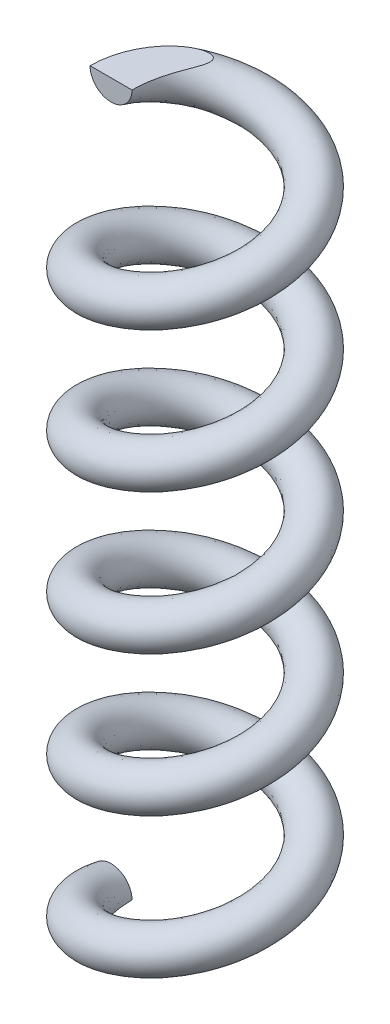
ISO-10303-21;
HEADER;
FILE_DESCRIPTION(('STEP AP214'),'2;1');
FILE_NAME('part.step','',(''),(''),'','','');
FILE_SCHEMA(('AUTOMOTIVE_DESIGN { 1 0 10303 214 1 1 1 1 }'));
ENDSEC;
DATA;
#1=APPLICATION_CONTEXT('core data for automotive mechanical design processes');
#2=APPLICATION_PROTOCOL_DEFINITION('international standard','automotive_design',2000,#1);
#3=PRODUCT_CONTEXT('',#1,'mechanical');
#4=PRODUCT('Part','Part','',(#3));
#5=PRODUCT_RELATED_PRODUCT_CATEGORY('part','',(#4));
#6=PRODUCT_DEFINITION_FORMATION('','',#4);
#7=PRODUCT_DEFINITION_CONTEXT('part definition',#1,'design');
#8=PRODUCT_DEFINITION('design','',#6,#7);
#9=PRODUCT_DEFINITION_SHAPE('','',#8);
#10=(LENGTH_UNIT() NAMED_UNIT(*) SI_UNIT(.MILLI.,.METRE.));
#11=(NAMED_UNIT(*) PLANE_ANGLE_UNIT() SI_UNIT($,.RADIAN.));
#12=(NAMED_UNIT(*) SI_UNIT($,.STERADIAN.) SOLID_ANGLE_UNIT());
#13=UNCERTAINTY_MEASURE_WITH_UNIT(LENGTH_MEASURE(1.E-05),#10,'distance_accuracy_value','');
#14=(GEOMETRIC_REPRESENTATION_CONTEXT(3) GLOBAL_UNCERTAINTY_ASSIGNED_CONTEXT((#13)) GLOBAL_UNIT_ASSIGNED_CONTEXT((#10,
#11,#12)) REPRESENTATION_CONTEXT('',''));
#15=CARTESIAN_POINT('',(0.,0.,0.));
#16=DIRECTION('',(0.,0.,1.));
#17=DIRECTION('',(1.,0.,0.));
#18=AXIS2_PLACEMENT_3D('',#15,#16,#17);
#19=CARTESIAN_POINT('',(-38.,45.4590433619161,9.77614774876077E-13));
#20=DIRECTION('',(0.,0.,1.));
#21=DIRECTION('',(1.,0.,0.));
#22=AXIS2_PLACEMENT_3D('',#19,#20,#21);
#23=PLANE('',#22);
#24=CARTESIAN_POINT('',(-38.,45.4590433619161,9.77614774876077E-13));
#25=DIRECTION('',(0.,0.,1.));
#26=DIRECTION('',(1.,0.,0.));
#27=AXIS2_PLACEMENT_3D('',#24,#25,#26);
#28=CIRCLE('',#27,3.5);
#29=CARTESIAN_POINT('',(-41.5,45.4590433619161,0.));
#30=VERTEX_POINT('',#29);
#31=CARTESIAN_POINT('',(-34.5,45.4590433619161,7.33211081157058E-13));
#32=VERTEX_POINT('',#31);
#33=EDGE_CURVE('E71',#30,#32,#28,.T.);
#34=ORIENTED_EDGE('',*,*,#33,.T.);
#35=DIRECTION('',(-1.,0.,0.));
#36=VECTOR('',#35,1.);
#37=CARTESIAN_POINT('',(-38.,45.4590433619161,9.77614774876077E-13));
#38=LINE('',#37,#36);
#39=EDGE_CURVE('E61',#32,#30,#38,.T.);
#40=ORIENTED_EDGE('',*,*,#39,.T.);
#41=EDGE_LOOP('',(#34,#40));
#42=FACE_BOUND('',#41,.T.);
#43=ADVANCED_FACE('F41',(#42),#23,.T.);
#44=CARTESIAN_POINT('',(-34.5,-71.5,0.));
#45=CARTESIAN_POINT('',(-34.5,-70.3304095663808,3.41165681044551));
#46=CARTESIAN_POINT('',(-32.4946784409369,-69.1608191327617,6.17174514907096));
#47=CARTESIAN_POINT('',(-30.4893568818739,-67.9912286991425,8.93183348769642));
#48=CARTESIAN_POINT('',(-27.2446784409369,-66.8216382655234,9.98609342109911));
#49=CARTESIAN_POINT('',(-24.,-65.6520478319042,11.0403533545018));
#50=CARTESIAN_POINT('',(-20.7553215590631,-64.482457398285,9.98609342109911));
#51=CARTESIAN_POINT('',(-17.5106431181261,-63.3128669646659,8.93183348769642));
#52=CARTESIAN_POINT('',(-15.5053215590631,-62.1432765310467,6.17174514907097));
#53=CARTESIAN_POINT('',(-13.5,-60.9736860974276,3.41165681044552));
#54=CARTESIAN_POINT('',(-13.5,-59.8040956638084,0.));
#55=CARTESIAN_POINT('',(-13.5,-58.6345052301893,-3.41165681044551));
#56=CARTESIAN_POINT('',(-15.5053215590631,-57.4649147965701,-6.17174514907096));
#57=CARTESIAN_POINT('',(-17.5106431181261,-56.2953243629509,-8.93183348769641));
#58=CARTESIAN_POINT('',(-20.7553215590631,-55.1257339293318,-9.98609342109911));
#59=CARTESIAN_POINT('',(-24.,-53.9561434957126,-11.0403533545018));
#60=CARTESIAN_POINT('',(-27.2446784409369,-52.7865530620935,-9.98609342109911));
#61=CARTESIAN_POINT('',(-30.4893568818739,-51.6169626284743,-8.93183348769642));
#62=CARTESIAN_POINT('',(-32.4946784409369,-50.4473721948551,-6.17174514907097));
#63=CARTESIAN_POINT('',(-34.5,-49.277781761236,-3.41165681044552));
#64=CARTESIAN_POINT('',(-34.5,-48.1081913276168,0.));
#65=CARTESIAN_POINT('',(-34.5,-46.9386008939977,3.41165681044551));
#66=CARTESIAN_POINT('',(-32.4946784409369,-45.7690104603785,6.17174514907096));
#67=CARTESIAN_POINT('',(-30.4893568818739,-44.5994200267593,8.93183348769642));
#68=CARTESIAN_POINT('',(-27.2446784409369,-43.4298295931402,9.98609342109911));
#69=CARTESIAN_POINT('',(-24.,-42.260239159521,11.0403533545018));
#70=CARTESIAN_POINT('',(-20.7553215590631,-41.0906487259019,9.98609342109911));
#71=CARTESIAN_POINT('',(-17.5106431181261,-39.9210582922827,8.93183348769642));
#72=CARTESIAN_POINT('',(-15.5053215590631,-38.7514678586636,6.17174514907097));
#73=CARTESIAN_POINT('',(-13.5,-37.5818774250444,3.41165681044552));
#74=CARTESIAN_POINT('',(-13.5,-36.4122869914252,0.));
#75=CARTESIAN_POINT('',(-13.5,-35.2426965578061,-3.41165681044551));
#76=CARTESIAN_POINT('',(-15.5053215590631,-34.0731061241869,-6.17174514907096));
#77=CARTESIAN_POINT('',(-17.5106431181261,-32.9035156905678,-8.93183348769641));
#78=CARTESIAN_POINT('',(-20.7553215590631,-31.7339252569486,-9.98609342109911));
#79=CARTESIAN_POINT('',(-24.,-30.5643348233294,-11.0403533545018));
#80=CARTESIAN_POINT('',(-27.2446784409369,-29.3947443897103,-9.98609342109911));
#81=CARTESIAN_POINT('',(-30.4893568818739,-28.2251539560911,-8.93183348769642));
#82=CARTESIAN_POINT('',(-32.4946784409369,-27.055563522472,-6.17174514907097));
#83=CARTESIAN_POINT('',(-34.5,-25.8859730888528,-3.41165681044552));
#84=CARTESIAN_POINT('',(-34.5,-24.7163826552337,0.));
#85=CARTESIAN_POINT('',(-34.5,-23.5467922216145,3.41165681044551));
#86=CARTESIAN_POINT('',(-32.4946784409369,-22.3772017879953,6.17174514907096));
#87=CARTESIAN_POINT('',(-30.4893568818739,-21.2076113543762,8.93183348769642));
#88=CARTESIAN_POINT('',(-27.2446784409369,-20.038020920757,9.98609342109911));
#89=CARTESIAN_POINT('',(-24.,-18.8684304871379,11.0403533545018));
#90=CARTESIAN_POINT('',(-20.7553215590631,-17.6988400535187,9.98609342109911));
#91=CARTESIAN_POINT('',(-17.5106431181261,-16.5292496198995,8.93183348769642));
#92=CARTESIAN_POINT('',(-15.5053215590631,-15.3596591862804,6.17174514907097));
#93=CARTESIAN_POINT('',(-13.5,-14.1900687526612,3.41165681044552));
#94=CARTESIAN_POINT('',(-13.5,-13.0204783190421,0.));
#95=CARTESIAN_POINT('',(-13.5,-11.8508878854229,-3.41165681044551));
#96=CARTESIAN_POINT('',(-15.5053215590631,-10.6812974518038,-6.17174514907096));
#97=CARTESIAN_POINT('',(-17.5106431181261,-9.51170701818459,-8.93183348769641));
#98=CARTESIAN_POINT('',(-20.7553215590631,-8.34211658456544,-9.98609342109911));
#99=CARTESIAN_POINT('',(-24.,-7.17252615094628,-11.0403533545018));
#100=CARTESIAN_POINT('',(-27.2446784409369,-6.00293571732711,-9.98609342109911));
#101=CARTESIAN_POINT('',(-30.4893568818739,-4.83334528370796,-8.93183348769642));
#102=CARTESIAN_POINT('',(-32.4946784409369,-3.66375485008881,-6.17174514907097));
#103=CARTESIAN_POINT('',(-34.5,-2.49416441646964,-3.41165681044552));
#104=CARTESIAN_POINT('',(-34.5,-1.32457398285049,0.));
#105=CARTESIAN_POINT('',(-34.5,-0.154983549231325,3.41165681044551));
#106=CARTESIAN_POINT('',(-32.4946784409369,1.01460688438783,6.17174514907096));
#107=CARTESIAN_POINT('',(-30.4893568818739,2.18419731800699,8.93183348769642));
#108=CARTESIAN_POINT('',(-27.2446784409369,3.35378775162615,9.98609342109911));
#109=CARTESIAN_POINT('',(-24.,4.5233781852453,11.0403533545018));
#110=CARTESIAN_POINT('',(-20.7553215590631,5.69296861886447,9.98609342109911));
#111=CARTESIAN_POINT('',(-17.5106431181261,6.86255905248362,8.93183348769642));
#112=CARTESIAN_POINT('',(-15.5053215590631,8.03214948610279,6.17174514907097));
#113=CARTESIAN_POINT('',(-13.5,9.20173991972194,3.41165681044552));
#114=CARTESIAN_POINT('',(-13.5,10.3713303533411,0.));
#115=CARTESIAN_POINT('',(-13.5,11.5409207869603,-3.41165681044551));
#116=CARTESIAN_POINT('',(-15.5053215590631,12.7105112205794,-6.17174514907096));
#117=CARTESIAN_POINT('',(-17.5106431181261,13.8801016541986,-8.93183348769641));
#118=CARTESIAN_POINT('',(-20.7553215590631,15.0496920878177,-9.98609342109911));
#119=CARTESIAN_POINT('',(-24.,16.2192825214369,-11.0403533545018));
#120=CARTESIAN_POINT('',(-27.2446784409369,17.388872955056,-9.98609342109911));
#121=CARTESIAN_POINT('',(-30.4893568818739,18.5584633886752,-8.93183348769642));
#122=CARTESIAN_POINT('',(-32.4946784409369,19.7280538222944,-6.17174514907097));
#123=CARTESIAN_POINT('',(-34.5,20.8976442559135,-3.41165681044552));
#124=CARTESIAN_POINT('',(-34.5,22.0672346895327,0.));
#125=CARTESIAN_POINT('',(-34.5,23.2368251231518,3.41165681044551));
#126=CARTESIAN_POINT('',(-32.4946784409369,24.406415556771,6.17174514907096));
#127=CARTESIAN_POINT('',(-30.4893568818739,25.5760059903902,8.93183348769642));
#128=CARTESIAN_POINT('',(-27.2446784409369,26.7455964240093,9.98609342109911));
#129=CARTESIAN_POINT('',(-24.,27.9151868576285,11.0403533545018));
#130=CARTESIAN_POINT('',(-20.7553215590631,29.0847772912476,9.98609342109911));
#131=CARTESIAN_POINT('',(-17.5106431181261,30.2543677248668,8.93183348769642));
#132=CARTESIAN_POINT('',(-15.5053215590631,31.4239581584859,6.17174514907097));
#133=CARTESIAN_POINT('',(-13.5,32.5935485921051,3.41165681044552));
#134=CARTESIAN_POINT('',(-13.5,33.7631390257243,0.));
#135=CARTESIAN_POINT('',(-13.5,34.9327294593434,-3.41165681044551));
#136=CARTESIAN_POINT('',(-15.5053215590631,36.1023198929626,-6.17174514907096));
#137=CARTESIAN_POINT('',(-17.5106431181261,37.2719103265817,-8.93183348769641));
#138=CARTESIAN_POINT('',(-20.7553215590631,38.4415007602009,-9.98609342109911));
#139=CARTESIAN_POINT('',(-24.,39.6110911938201,-11.0403533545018));
#140=CARTESIAN_POINT('',(-27.2446784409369,40.7806816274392,-9.98609342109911));
#141=CARTESIAN_POINT('',(-30.4893568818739,41.9502720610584,-8.93183348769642));
#142=CARTESIAN_POINT('',(-32.4946784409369,43.1198624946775,-6.17174514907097));
#143=CARTESIAN_POINT('',(-34.5,44.2894529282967,-3.41165681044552));
#144=CARTESIAN_POINT('',(-34.5,45.4590433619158,0.));
#145=CARTESIAN_POINT('',(-34.5,-64.5,0.));
#146=CARTESIAN_POINT('',(-34.5,-63.3304095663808,3.41165681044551));
#147=CARTESIAN_POINT('',(-32.4946784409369,-62.1608191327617,6.17174514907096));
#148=CARTESIAN_POINT('',(-30.4893568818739,-60.9912286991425,8.93183348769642));
#149=CARTESIAN_POINT('',(-27.2446784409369,-59.8216382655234,9.98609342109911));
#150=CARTESIAN_POINT('',(-24.,-58.6520478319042,11.0403533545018));
#151=CARTESIAN_POINT('',(-20.7553215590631,-57.482457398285,9.98609342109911));
#152=CARTESIAN_POINT('',(-17.5106431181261,-56.3128669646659,8.93183348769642));
#153=CARTESIAN_POINT('',(-15.5053215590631,-55.1432765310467,6.17174514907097));
#154=CARTESIAN_POINT('',(-13.5,-53.9736860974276,3.41165681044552));
#155=CARTESIAN_POINT('',(-13.5,-52.8040956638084,0.));
#156=CARTESIAN_POINT('',(-13.5,-51.6345052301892,-3.41165681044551));
#157=CARTESIAN_POINT('',(-15.5053215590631,-50.4649147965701,-6.17174514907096));
#158=CARTESIAN_POINT('',(-17.5106431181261,-49.2953243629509,-8.93183348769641));
#159=CARTESIAN_POINT('',(-20.7553215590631,-48.1257339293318,-9.98609342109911));
#160=CARTESIAN_POINT('',(-24.,-46.9561434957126,-11.0403533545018));
#161=CARTESIAN_POINT('',(-27.2446784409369,-45.7865530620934,-9.98609342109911));
#162=CARTESIAN_POINT('',(-30.4893568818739,-44.6169626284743,-8.93183348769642));
#163=CARTESIAN_POINT('',(-32.4946784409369,-43.4473721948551,-6.17174514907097));
#164=CARTESIAN_POINT('',(-34.5,-42.277781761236,-3.41165681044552));
#165=CARTESIAN_POINT('',(-34.5,-41.1081913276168,0.));
#166=CARTESIAN_POINT('',(-34.5,-39.9386008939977,3.41165681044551));
#167=CARTESIAN_POINT('',(-32.4946784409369,-38.7690104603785,6.17174514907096));
#168=CARTESIAN_POINT('',(-30.4893568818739,-37.5994200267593,8.93183348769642));
#169=CARTESIAN_POINT('',(-27.2446784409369,-36.4298295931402,9.98609342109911));
#170=CARTESIAN_POINT('',(-24.,-35.260239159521,11.0403533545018));
#171=CARTESIAN_POINT('',(-20.7553215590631,-34.0906487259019,9.98609342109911));
#172=CARTESIAN_POINT('',(-17.5106431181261,-32.9210582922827,8.93183348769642));
#173=CARTESIAN_POINT('',(-15.5053215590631,-31.7514678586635,6.17174514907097));
#174=CARTESIAN_POINT('',(-13.5,-30.5818774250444,3.41165681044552));
#175=CARTESIAN_POINT('',(-13.5,-29.4122869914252,0.));
#176=CARTESIAN_POINT('',(-13.5,-28.2426965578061,-3.41165681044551));
#177=CARTESIAN_POINT('',(-15.5053215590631,-27.0731061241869,-6.17174514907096));
#178=CARTESIAN_POINT('',(-17.5106431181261,-25.9035156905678,-8.93183348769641));
#179=CARTESIAN_POINT('',(-20.7553215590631,-24.7339252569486,-9.98609342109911));
#180=CARTESIAN_POINT('',(-24.,-23.5643348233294,-11.0403533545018));
#181=CARTESIAN_POINT('',(-27.2446784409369,-22.3947443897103,-9.98609342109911));
#182=CARTESIAN_POINT('',(-30.4893568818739,-21.2251539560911,-8.93183348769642));
#183=CARTESIAN_POINT('',(-32.4946784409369,-20.055563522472,-6.17174514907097));
#184=CARTESIAN_POINT('',(-34.5,-18.8859730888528,-3.41165681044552));
#185=CARTESIAN_POINT('',(-34.5,-17.7163826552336,0.));
#186=CARTESIAN_POINT('',(-34.5,-16.5467922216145,3.41165681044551));
#187=CARTESIAN_POINT('',(-32.4946784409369,-15.3772017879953,6.17174514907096));
#188=CARTESIAN_POINT('',(-30.4893568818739,-14.2076113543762,8.93183348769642));
#189=CARTESIAN_POINT('',(-27.2446784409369,-13.038020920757,9.98609342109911));
#190=CARTESIAN_POINT('',(-24.,-11.8684304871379,11.0403533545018));
#191=CARTESIAN_POINT('',(-20.7553215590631,-10.6988400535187,9.98609342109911));
#192=CARTESIAN_POINT('',(-17.5106431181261,-9.52924961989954,8.93183348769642));
#193=CARTESIAN_POINT('',(-15.5053215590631,-8.35965918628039,6.17174514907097));
#194=CARTESIAN_POINT('',(-13.5,-7.19006875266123,3.41165681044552));
#195=CARTESIAN_POINT('',(-13.5,-6.02047831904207,0.));
#196=CARTESIAN_POINT('',(-13.5,-4.85088788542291,-3.41165681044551));
#197=CARTESIAN_POINT('',(-15.5053215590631,-3.68129745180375,-6.17174514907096));
#198=CARTESIAN_POINT('',(-17.5106431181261,-2.51170701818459,-8.93183348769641));
#199=CARTESIAN_POINT('',(-20.7553215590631,-1.34211658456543,-9.98609342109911));
#200=CARTESIAN_POINT('',(-24.,-0.172526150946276,-11.0403533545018));
#201=CARTESIAN_POINT('',(-27.2446784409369,0.997064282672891,-9.98609342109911));
#202=CARTESIAN_POINT('',(-30.4893568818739,2.16665471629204,-8.93183348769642));
#203=CARTESIAN_POINT('',(-32.4946784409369,3.3362451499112,-6.17174514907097));
#204=CARTESIAN_POINT('',(-34.5,4.50583558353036,-3.41165681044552));
#205=CARTESIAN_POINT('',(-34.5,5.67542601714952,0.));
#206=CARTESIAN_POINT('',(-34.5,6.84501645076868,3.41165681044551));
#207=CARTESIAN_POINT('',(-32.4946784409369,8.01460688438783,6.17174514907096));
#208=CARTESIAN_POINT('',(-30.4893568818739,9.184197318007,8.93183348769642));
#209=CARTESIAN_POINT('',(-27.2446784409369,10.3537877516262,9.98609342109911));
#210=CARTESIAN_POINT('',(-24.,11.5233781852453,11.0403533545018));
#211=CARTESIAN_POINT('',(-20.7553215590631,12.6929686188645,9.98609342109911));
#212=CARTESIAN_POINT('',(-17.5106431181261,13.8625590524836,8.93183348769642));
#213=CARTESIAN_POINT('',(-15.5053215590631,15.0321494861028,6.17174514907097));
#214=CARTESIAN_POINT('',(-13.5,16.2017399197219,3.41165681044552));
#215=CARTESIAN_POINT('',(-13.5,17.3713303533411,0.));
#216=CARTESIAN_POINT('',(-13.5,18.5409207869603,-3.41165681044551));
#217=CARTESIAN_POINT('',(-15.5053215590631,19.7105112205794,-6.17174514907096));
#218=CARTESIAN_POINT('',(-17.5106431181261,20.8801016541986,-8.93183348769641));
#219=CARTESIAN_POINT('',(-20.7553215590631,22.0496920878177,-9.98609342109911));
#220=CARTESIAN_POINT('',(-24.,23.2192825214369,-11.0403533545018));
#221=CARTESIAN_POINT('',(-27.2446784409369,24.3888729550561,-9.98609342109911));
#222=CARTESIAN_POINT('',(-30.4893568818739,25.5584633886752,-8.93183348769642));
#223=CARTESIAN_POINT('',(-32.4946784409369,26.7280538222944,-6.17174514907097));
#224=CARTESIAN_POINT('',(-34.5,27.8976442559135,-3.41165681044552));
#225=CARTESIAN_POINT('',(-34.5,29.0672346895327,0.));
#226=CARTESIAN_POINT('',(-34.5,30.2368251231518,3.41165681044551));
#227=CARTESIAN_POINT('',(-32.4946784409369,31.406415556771,6.17174514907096));
#228=CARTESIAN_POINT('',(-30.4893568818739,32.5760059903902,8.93183348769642));
#229=CARTESIAN_POINT('',(-27.2446784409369,33.7455964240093,9.98609342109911));
#230=CARTESIAN_POINT('',(-24.,34.9151868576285,11.0403533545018));
#231=CARTESIAN_POINT('',(-20.7553215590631,36.0847772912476,9.98609342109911));
#232=CARTESIAN_POINT('',(-17.5106431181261,37.2543677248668,8.93183348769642));
#233=CARTESIAN_POINT('',(-15.5053215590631,38.423958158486,6.17174514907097));
#234=CARTESIAN_POINT('',(-13.5,39.5935485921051,3.41165681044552));
#235=CARTESIAN_POINT('',(-13.5,40.7631390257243,0.));
#236=CARTESIAN_POINT('',(-13.5,41.9327294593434,-3.41165681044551));
#237=CARTESIAN_POINT('',(-15.5053215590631,43.1023198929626,-6.17174514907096));
#238=CARTESIAN_POINT('',(-17.5106431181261,44.2719103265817,-8.93183348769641));
#239=CARTESIAN_POINT('',(-20.7553215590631,45.4415007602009,-9.98609342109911));
#240=CARTESIAN_POINT('',(-24.,46.6110911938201,-11.0403533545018));
#241=CARTESIAN_POINT('',(-27.2446784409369,47.7806816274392,-9.98609342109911));
#242=CARTESIAN_POINT('',(-30.4893568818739,48.9502720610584,-8.93183348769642));
#243=CARTESIAN_POINT('',(-32.4946784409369,50.1198624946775,-6.17174514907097));
#244=CARTESIAN_POINT('',(-34.5,51.2894529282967,-3.41165681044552));
#245=CARTESIAN_POINT('',(-34.5,52.4590433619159,0.));
#246=CARTESIAN_POINT('',(-41.5,-64.5,0.));
#247=CARTESIAN_POINT('',(-41.5,-63.3304095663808,5.68609468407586));
#248=CARTESIAN_POINT('',(-38.1577974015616,-62.1608191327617,10.2862419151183));
#249=CARTESIAN_POINT('',(-34.8155948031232,-60.9912286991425,14.8863891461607));
#250=CARTESIAN_POINT('',(-29.4077974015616,-59.8216382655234,16.6434890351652));
#251=CARTESIAN_POINT('',(-24.,-58.6520478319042,18.4005889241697));
#252=CARTESIAN_POINT('',(-18.5922025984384,-57.482457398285,16.6434890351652));
#253=CARTESIAN_POINT('',(-13.1844051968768,-56.3128669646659,14.8863891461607));
#254=CARTESIAN_POINT('',(-9.84220259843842,-55.1432765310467,10.2862419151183));
#255=CARTESIAN_POINT('',(-6.5,-53.9736860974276,5.68609468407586));
#256=CARTESIAN_POINT('',(-6.5,-52.8040956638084,0.));
#257=CARTESIAN_POINT('',(-6.5,-51.6345052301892,-5.68609468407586));
#258=CARTESIAN_POINT('',(-9.84220259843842,-50.4649147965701,-10.2862419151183));
#259=CARTESIAN_POINT('',(-13.1844051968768,-49.2953243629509,-14.8863891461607));
#260=CARTESIAN_POINT('',(-18.5922025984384,-48.1257339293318,-16.6434890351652));
#261=CARTESIAN_POINT('',(-24.,-46.9561434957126,-18.4005889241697));
#262=CARTESIAN_POINT('',(-29.4077974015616,-45.7865530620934,-16.6434890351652));
#263=CARTESIAN_POINT('',(-34.8155948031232,-44.6169626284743,-14.8863891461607));
#264=CARTESIAN_POINT('',(-38.1577974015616,-43.4473721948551,-10.2862419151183));
#265=CARTESIAN_POINT('',(-41.5,-42.277781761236,-5.68609468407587));
#266=CARTESIAN_POINT('',(-41.5,-41.1081913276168,0.));
#267=CARTESIAN_POINT('',(-41.5,-39.9386008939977,5.68609468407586));
#268=CARTESIAN_POINT('',(-38.1577974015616,-38.7690104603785,10.2862419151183));
#269=CARTESIAN_POINT('',(-34.8155948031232,-37.5994200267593,14.8863891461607));
#270=CARTESIAN_POINT('',(-29.4077974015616,-36.4298295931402,16.6434890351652));
#271=CARTESIAN_POINT('',(-24.,-35.260239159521,18.4005889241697));
#272=CARTESIAN_POINT('',(-18.5922025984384,-34.0906487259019,16.6434890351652));
#273=CARTESIAN_POINT('',(-13.1844051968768,-32.9210582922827,14.8863891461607));
#274=CARTESIAN_POINT('',(-9.84220259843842,-31.7514678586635,10.2862419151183));
#275=CARTESIAN_POINT('',(-6.5,-30.5818774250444,5.68609468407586));
#276=CARTESIAN_POINT('',(-6.5,-29.4122869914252,0.));
#277=CARTESIAN_POINT('',(-6.5,-28.2426965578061,-5.68609468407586));
#278=CARTESIAN_POINT('',(-9.84220259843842,-27.0731061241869,-10.2862419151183));
#279=CARTESIAN_POINT('',(-13.1844051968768,-25.9035156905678,-14.8863891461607));
#280=CARTESIAN_POINT('',(-18.5922025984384,-24.7339252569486,-16.6434890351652));
#281=CARTESIAN_POINT('',(-24.,-23.5643348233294,-18.4005889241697));
#282=CARTESIAN_POINT('',(-29.4077974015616,-22.3947443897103,-16.6434890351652));
#283=CARTESIAN_POINT('',(-34.8155948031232,-21.2251539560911,-14.8863891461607));
#284=CARTESIAN_POINT('',(-38.1577974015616,-20.055563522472,-10.2862419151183));
#285=CARTESIAN_POINT('',(-41.5,-18.8859730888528,-5.68609468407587));
#286=CARTESIAN_POINT('',(-41.5,-17.7163826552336,0.));
#287=CARTESIAN_POINT('',(-41.5,-16.5467922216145,5.68609468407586));
#288=CARTESIAN_POINT('',(-38.1577974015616,-15.3772017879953,10.2862419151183));
#289=CARTESIAN_POINT('',(-34.8155948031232,-14.2076113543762,14.8863891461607));
#290=CARTESIAN_POINT('',(-29.4077974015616,-13.038020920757,16.6434890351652));
#291=CARTESIAN_POINT('',(-24.,-11.8684304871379,18.4005889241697));
#292=CARTESIAN_POINT('',(-18.5922025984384,-10.6988400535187,16.6434890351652));
#293=CARTESIAN_POINT('',(-13.1844051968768,-9.52924961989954,14.8863891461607));
#294=CARTESIAN_POINT('',(-9.84220259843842,-8.35965918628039,10.2862419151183));
#295=CARTESIAN_POINT('',(-6.5,-7.19006875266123,5.68609468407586));
#296=CARTESIAN_POINT('',(-6.5,-6.02047831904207,0.));
#297=CARTESIAN_POINT('',(-6.5,-4.85088788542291,-5.68609468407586));
#298=CARTESIAN_POINT('',(-9.84220259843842,-3.68129745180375,-10.2862419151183));
#299=CARTESIAN_POINT('',(-13.1844051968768,-2.51170701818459,-14.8863891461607));
#300=CARTESIAN_POINT('',(-18.5922025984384,-1.34211658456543,-16.6434890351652));
#301=CARTESIAN_POINT('',(-24.,-0.172526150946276,-18.4005889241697));
#302=CARTESIAN_POINT('',(-29.4077974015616,0.997064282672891,-16.6434890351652));
#303=CARTESIAN_POINT('',(-34.8155948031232,2.16665471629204,-14.8863891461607));
#304=CARTESIAN_POINT('',(-38.1577974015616,3.3362451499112,-10.2862419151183));
#305=CARTESIAN_POINT('',(-41.5,4.50583558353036,-5.68609468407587));
#306=CARTESIAN_POINT('',(-41.5,5.67542601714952,0.));
#307=CARTESIAN_POINT('',(-41.5,6.84501645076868,5.68609468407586));
#308=CARTESIAN_POINT('',(-38.1577974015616,8.01460688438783,10.2862419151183));
#309=CARTESIAN_POINT('',(-34.8155948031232,9.184197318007,14.8863891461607));
#310=CARTESIAN_POINT('',(-29.4077974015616,10.3537877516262,16.6434890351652));
#311=CARTESIAN_POINT('',(-24.,11.5233781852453,18.4005889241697));
#312=CARTESIAN_POINT('',(-18.5922025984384,12.6929686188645,16.6434890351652));
#313=CARTESIAN_POINT('',(-13.1844051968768,13.8625590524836,14.8863891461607));
#314=CARTESIAN_POINT('',(-9.84220259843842,15.0321494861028,10.2862419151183));
#315=CARTESIAN_POINT('',(-6.5,16.2017399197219,5.68609468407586));
#316=CARTESIAN_POINT('',(-6.5,17.3713303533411,0.));
#317=CARTESIAN_POINT('',(-6.5,18.5409207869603,-5.68609468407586));
#318=CARTESIAN_POINT('',(-9.84220259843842,19.7105112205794,-10.2862419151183));
#319=CARTESIAN_POINT('',(-13.1844051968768,20.8801016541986,-14.8863891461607));
#320=CARTESIAN_POINT('',(-18.5922025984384,22.0496920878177,-16.6434890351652));
#321=CARTESIAN_POINT('',(-24.,23.2192825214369,-18.4005889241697));
#322=CARTESIAN_POINT('',(-29.4077974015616,24.3888729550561,-16.6434890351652));
#323=CARTESIAN_POINT('',(-34.8155948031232,25.5584633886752,-14.8863891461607));
#324=CARTESIAN_POINT('',(-38.1577974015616,26.7280538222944,-10.2862419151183));
#325=CARTESIAN_POINT('',(-41.5,27.8976442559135,-5.68609468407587));
#326=CARTESIAN_POINT('',(-41.5,29.0672346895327,0.));
#327=CARTESIAN_POINT('',(-41.5,30.2368251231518,5.68609468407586));
#328=CARTESIAN_POINT('',(-38.1577974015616,31.406415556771,10.2862419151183));
#329=CARTESIAN_POINT('',(-34.8155948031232,32.5760059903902,14.8863891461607));
#330=CARTESIAN_POINT('',(-29.4077974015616,33.7455964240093,16.6434890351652));
#331=CARTESIAN_POINT('',(-24.,34.9151868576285,18.4005889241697));
#332=CARTESIAN_POINT('',(-18.5922025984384,36.0847772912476,16.6434890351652));
#333=CARTESIAN_POINT('',(-13.1844051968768,37.2543677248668,14.8863891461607));
#334=CARTESIAN_POINT('',(-9.84220259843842,38.423958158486,10.2862419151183));
#335=CARTESIAN_POINT('',(-6.5,39.5935485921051,5.68609468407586));
#336=CARTESIAN_POINT('',(-6.5,40.7631390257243,0.));
#337=CARTESIAN_POINT('',(-6.5,41.9327294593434,-5.68609468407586));
#338=CARTESIAN_POINT('',(-9.84220259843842,43.1023198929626,-10.2862419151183));
#339=CARTESIAN_POINT('',(-13.1844051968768,44.2719103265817,-14.8863891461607));
#340=CARTESIAN_POINT('',(-18.5922025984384,45.4415007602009,-16.6434890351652));
#341=CARTESIAN_POINT('',(-24.,46.6110911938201,-18.4005889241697));
#342=CARTESIAN_POINT('',(-29.4077974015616,47.7806816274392,-16.6434890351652));
#343=CARTESIAN_POINT('',(-34.8155948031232,48.9502720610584,-14.8863891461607));
#344=CARTESIAN_POINT('',(-38.1577974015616,50.1198624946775,-10.2862419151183));
#345=CARTESIAN_POINT('',(-41.5,51.2894529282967,-5.68609468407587));
#346=CARTESIAN_POINT('',(-41.5,52.4590433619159,0.));
#347=CARTESIAN_POINT('',(-41.5,-71.5,0.));
#348=CARTESIAN_POINT('',(-41.5,-70.3304095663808,5.68609468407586));
#349=CARTESIAN_POINT('',(-38.1577974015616,-69.1608191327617,10.2862419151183));
#350=CARTESIAN_POINT('',(-34.8155948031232,-67.9912286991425,14.8863891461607));
#351=CARTESIAN_POINT('',(-29.4077974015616,-66.8216382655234,16.6434890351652));
#352=CARTESIAN_POINT('',(-24.,-65.6520478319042,18.4005889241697));
#353=CARTESIAN_POINT('',(-18.5922025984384,-64.482457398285,16.6434890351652));
#354=CARTESIAN_POINT('',(-13.1844051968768,-63.3128669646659,14.8863891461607));
#355=CARTESIAN_POINT('',(-9.84220259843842,-62.1432765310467,10.2862419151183));
#356=CARTESIAN_POINT('',(-6.5,-60.9736860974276,5.68609468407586));
#357=CARTESIAN_POINT('',(-6.5,-59.8040956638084,0.));
#358=CARTESIAN_POINT('',(-6.5,-58.6345052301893,-5.68609468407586));
#359=CARTESIAN_POINT('',(-9.84220259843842,-57.4649147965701,-10.2862419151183));
#360=CARTESIAN_POINT('',(-13.1844051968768,-56.2953243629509,-14.8863891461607));
#361=CARTESIAN_POINT('',(-18.5922025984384,-55.1257339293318,-16.6434890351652));
#362=CARTESIAN_POINT('',(-24.,-53.9561434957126,-18.4005889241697));
#363=CARTESIAN_POINT('',(-29.4077974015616,-52.7865530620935,-16.6434890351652));
#364=CARTESIAN_POINT('',(-34.8155948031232,-51.6169626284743,-14.8863891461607));
#365=CARTESIAN_POINT('',(-38.1577974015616,-50.4473721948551,-10.2862419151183));
#366=CARTESIAN_POINT('',(-41.5,-49.277781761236,-5.68609468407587));
#367=CARTESIAN_POINT('',(-41.5,-48.1081913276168,0.));
#368=CARTESIAN_POINT('',(-41.5,-46.9386008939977,5.68609468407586));
#369=CARTESIAN_POINT('',(-38.1577974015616,-45.7690104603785,10.2862419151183));
#370=CARTESIAN_POINT('',(-34.8155948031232,-44.5994200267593,14.8863891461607));
#371=CARTESIAN_POINT('',(-29.4077974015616,-43.4298295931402,16.6434890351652));
#372=CARTESIAN_POINT('',(-24.,-42.260239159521,18.4005889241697));
#373=CARTESIAN_POINT('',(-18.5922025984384,-41.0906487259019,16.6434890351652));
#374=CARTESIAN_POINT('',(-13.1844051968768,-39.9210582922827,14.8863891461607));
#375=CARTESIAN_POINT('',(-9.84220259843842,-38.7514678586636,10.2862419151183));
#376=CARTESIAN_POINT('',(-6.5,-37.5818774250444,5.68609468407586));
#377=CARTESIAN_POINT('',(-6.5,-36.4122869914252,0.));
#378=CARTESIAN_POINT('',(-6.5,-35.2426965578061,-5.68609468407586));
#379=CARTESIAN_POINT('',(-9.84220259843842,-34.0731061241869,-10.2862419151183));
#380=CARTESIAN_POINT('',(-13.1844051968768,-32.9035156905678,-14.8863891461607));
#381=CARTESIAN_POINT('',(-18.5922025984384,-31.7339252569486,-16.6434890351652));
#382=CARTESIAN_POINT('',(-24.,-30.5643348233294,-18.4005889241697));
#383=CARTESIAN_POINT('',(-29.4077974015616,-29.3947443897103,-16.6434890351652));
#384=CARTESIAN_POINT('',(-34.8155948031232,-28.2251539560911,-14.8863891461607));
#385=CARTESIAN_POINT('',(-38.1577974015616,-27.055563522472,-10.2862419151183));
#386=CARTESIAN_POINT('',(-41.5,-25.8859730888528,-5.68609468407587));
#387=CARTESIAN_POINT('',(-41.5,-24.7163826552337,0.));
#388=CARTESIAN_POINT('',(-41.5,-23.5467922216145,5.68609468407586));
#389=CARTESIAN_POINT('',(-38.1577974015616,-22.3772017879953,10.2862419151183));
#390=CARTESIAN_POINT('',(-34.8155948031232,-21.2076113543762,14.8863891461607));
#391=CARTESIAN_POINT('',(-29.4077974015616,-20.038020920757,16.6434890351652));
#392=CARTESIAN_POINT('',(-24.,-18.8684304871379,18.4005889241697));
#393=CARTESIAN_POINT('',(-18.5922025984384,-17.6988400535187,16.6434890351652));
#394=CARTESIAN_POINT('',(-13.1844051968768,-16.5292496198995,14.8863891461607));
#395=CARTESIAN_POINT('',(-9.84220259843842,-15.3596591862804,10.2862419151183));
#396=CARTESIAN_POINT('',(-6.5,-14.1900687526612,5.68609468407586));
#397=CARTESIAN_POINT('',(-6.5,-13.0204783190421,0.));
#398=CARTESIAN_POINT('',(-6.5,-11.8508878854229,-5.68609468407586));
#399=CARTESIAN_POINT('',(-9.84220259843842,-10.6812974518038,-10.2862419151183));
#400=CARTESIAN_POINT('',(-13.1844051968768,-9.51170701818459,-14.8863891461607));
#401=CARTESIAN_POINT('',(-18.5922025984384,-8.34211658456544,-16.6434890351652));
#402=CARTESIAN_POINT('',(-24.,-7.17252615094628,-18.4005889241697));
#403=CARTESIAN_POINT('',(-29.4077974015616,-6.00293571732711,-16.6434890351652));
#404=CARTESIAN_POINT('',(-34.8155948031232,-4.83334528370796,-14.8863891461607));
#405=CARTESIAN_POINT('',(-38.1577974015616,-3.66375485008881,-10.2862419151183));
#406=CARTESIAN_POINT('',(-41.5,-2.49416441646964,-5.68609468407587));
#407=CARTESIAN_POINT('',(-41.5,-1.32457398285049,0.));
#408=CARTESIAN_POINT('',(-41.5,-0.154983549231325,5.68609468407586));
#409=CARTESIAN_POINT('',(-38.1577974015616,1.01460688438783,10.2862419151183));
#410=CARTESIAN_POINT('',(-34.8155948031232,2.18419731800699,14.8863891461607));
#411=CARTESIAN_POINT('',(-29.4077974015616,3.35378775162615,16.6434890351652));
#412=CARTESIAN_POINT('',(-24.,4.5233781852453,18.4005889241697));
#413=CARTESIAN_POINT('',(-18.5922025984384,5.69296861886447,16.6434890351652));
#414=CARTESIAN_POINT('',(-13.1844051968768,6.86255905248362,14.8863891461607));
#415=CARTESIAN_POINT('',(-9.84220259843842,8.03214948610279,10.2862419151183));
#416=CARTESIAN_POINT('',(-6.5,9.20173991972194,5.68609468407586));
#417=CARTESIAN_POINT('',(-6.5,10.3713303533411,0.));
#418=CARTESIAN_POINT('',(-6.5,11.5409207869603,-5.68609468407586));
#419=CARTESIAN_POINT('',(-9.84220259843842,12.7105112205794,-10.2862419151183));
#420=CARTESIAN_POINT('',(-13.1844051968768,13.8801016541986,-14.8863891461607));
#421=CARTESIAN_POINT('',(-18.5922025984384,15.0496920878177,-16.6434890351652));
#422=CARTESIAN_POINT('',(-24.,16.2192825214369,-18.4005889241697));
#423=CARTESIAN_POINT('',(-29.4077974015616,17.388872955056,-16.6434890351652));
#424=CARTESIAN_POINT('',(-34.8155948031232,18.5584633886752,-14.8863891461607));
#425=CARTESIAN_POINT('',(-38.1577974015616,19.7280538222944,-10.2862419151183));
#426=CARTESIAN_POINT('',(-41.5,20.8976442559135,-5.68609468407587));
#427=CARTESIAN_POINT('',(-41.5,22.0672346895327,0.));
#428=CARTESIAN_POINT('',(-41.5,23.2368251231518,5.68609468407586));
#429=CARTESIAN_POINT('',(-38.1577974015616,24.406415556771,10.2862419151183));
#430=CARTESIAN_POINT('',(-34.8155948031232,25.5760059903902,14.8863891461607));
#431=CARTESIAN_POINT('',(-29.4077974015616,26.7455964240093,16.6434890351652));
#432=CARTESIAN_POINT('',(-24.,27.9151868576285,18.4005889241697));
#433=CARTESIAN_POINT('',(-18.5922025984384,29.0847772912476,16.6434890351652));
#434=CARTESIAN_POINT('',(-13.1844051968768,30.2543677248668,14.8863891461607));
#435=CARTESIAN_POINT('',(-9.84220259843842,31.4239581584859,10.2862419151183));
#436=CARTESIAN_POINT('',(-6.5,32.5935485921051,5.68609468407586));
#437=CARTESIAN_POINT('',(-6.5,33.7631390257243,0.));
#438=CARTESIAN_POINT('',(-6.5,34.9327294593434,-5.68609468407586));
#439=CARTESIAN_POINT('',(-9.84220259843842,36.1023198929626,-10.2862419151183));
#440=CARTESIAN_POINT('',(-13.1844051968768,37.2719103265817,-14.8863891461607));
#441=CARTESIAN_POINT('',(-18.5922025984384,38.4415007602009,-16.6434890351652));
#442=CARTESIAN_POINT('',(-24.,39.6110911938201,-18.4005889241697));
#443=CARTESIAN_POINT('',(-29.4077974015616,40.7806816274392,-16.6434890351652));
#444=CARTESIAN_POINT('',(-34.8155948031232,41.9502720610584,-14.8863891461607));
#445=CARTESIAN_POINT('',(-38.1577974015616,43.1198624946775,-10.2862419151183));
#446=CARTESIAN_POINT('',(-41.5,44.2894529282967,-5.68609468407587));
#447=CARTESIAN_POINT('',(-41.5,45.4590433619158,0.));
#448=CARTESIAN_POINT('',(-41.5,-78.5,0.));
#449=CARTESIAN_POINT('',(-41.5,-77.3304095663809,5.68609468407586));
#450=CARTESIAN_POINT('',(-38.1577974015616,-76.1608191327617,10.2862419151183));
#451=CARTESIAN_POINT('',(-34.8155948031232,-74.9912286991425,14.8863891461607));
#452=CARTESIAN_POINT('',(-29.4077974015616,-73.8216382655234,16.6434890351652));
#453=CARTESIAN_POINT('',(-24.,-72.6520478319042,18.4005889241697));
#454=CARTESIAN_POINT('',(-18.5922025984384,-71.482457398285,16.6434890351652));
#455=CARTESIAN_POINT('',(-13.1844051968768,-70.3128669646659,14.8863891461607));
#456=CARTESIAN_POINT('',(-9.84220259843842,-69.1432765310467,10.2862419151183));
#457=CARTESIAN_POINT('',(-6.5,-67.9736860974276,5.68609468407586));
#458=CARTESIAN_POINT('',(-6.5,-66.8040956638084,0.));
#459=CARTESIAN_POINT('',(-6.5,-65.6345052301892,-5.68609468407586));
#460=CARTESIAN_POINT('',(-9.84220259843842,-64.4649147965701,-10.2862419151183));
#461=CARTESIAN_POINT('',(-13.1844051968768,-63.2953243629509,-14.8863891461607));
#462=CARTESIAN_POINT('',(-18.5922025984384,-62.1257339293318,-16.6434890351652));
#463=CARTESIAN_POINT('',(-24.,-60.9561434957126,-18.4005889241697));
#464=CARTESIAN_POINT('',(-29.4077974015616,-59.7865530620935,-16.6434890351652));
#465=CARTESIAN_POINT('',(-34.8155948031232,-58.6169626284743,-14.8863891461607));
#466=CARTESIAN_POINT('',(-38.1577974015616,-57.4473721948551,-10.2862419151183));
#467=CARTESIAN_POINT('',(-41.5,-56.277781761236,-5.68609468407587));
#468=CARTESIAN_POINT('',(-41.5,-55.1081913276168,0.));
#469=CARTESIAN_POINT('',(-41.5,-53.9386008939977,5.68609468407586));
#470=CARTESIAN_POINT('',(-38.1577974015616,-52.7690104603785,10.2862419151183));
#471=CARTESIAN_POINT('',(-34.8155948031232,-51.5994200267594,14.8863891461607));
#472=CARTESIAN_POINT('',(-29.4077974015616,-50.4298295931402,16.6434890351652));
#473=CARTESIAN_POINT('',(-24.,-49.260239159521,18.4005889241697));
#474=CARTESIAN_POINT('',(-18.5922025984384,-48.0906487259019,16.6434890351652));
#475=CARTESIAN_POINT('',(-13.1844051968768,-46.9210582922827,14.8863891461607));
#476=CARTESIAN_POINT('',(-9.84220259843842,-45.7514678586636,10.2862419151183));
#477=CARTESIAN_POINT('',(-6.5,-44.5818774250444,5.68609468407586));
#478=CARTESIAN_POINT('',(-6.5,-43.4122869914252,0.));
#479=CARTESIAN_POINT('',(-6.5,-42.2426965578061,-5.68609468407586));
#480=CARTESIAN_POINT('',(-9.84220259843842,-41.0731061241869,-10.2862419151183));
#481=CARTESIAN_POINT('',(-13.1844051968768,-39.9035156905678,-14.8863891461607));
#482=CARTESIAN_POINT('',(-18.5922025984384,-38.7339252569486,-16.6434890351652));
#483=CARTESIAN_POINT('',(-24.,-37.5643348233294,-18.4005889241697));
#484=CARTESIAN_POINT('',(-29.4077974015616,-36.3947443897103,-16.6434890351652));
#485=CARTESIAN_POINT('',(-34.8155948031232,-35.2251539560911,-14.8863891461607));
#486=CARTESIAN_POINT('',(-38.1577974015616,-34.055563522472,-10.2862419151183));
#487=CARTESIAN_POINT('',(-41.5,-32.8859730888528,-5.68609468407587));
#488=CARTESIAN_POINT('',(-41.5,-31.7163826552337,0.));
#489=CARTESIAN_POINT('',(-41.5,-30.5467922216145,5.68609468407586));
#490=CARTESIAN_POINT('',(-38.1577974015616,-29.3772017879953,10.2862419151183));
#491=CARTESIAN_POINT('',(-34.8155948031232,-28.2076113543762,14.8863891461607));
#492=CARTESIAN_POINT('',(-29.4077974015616,-27.038020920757,16.6434890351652));
#493=CARTESIAN_POINT('',(-24.,-25.8684304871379,18.4005889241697));
#494=CARTESIAN_POINT('',(-18.5922025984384,-24.6988400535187,16.6434890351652));
#495=CARTESIAN_POINT('',(-13.1844051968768,-23.5292496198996,14.8863891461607));
#496=CARTESIAN_POINT('',(-9.84220259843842,-22.3596591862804,10.2862419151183));
#497=CARTESIAN_POINT('',(-6.5,-21.1900687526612,5.68609468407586));
#498=CARTESIAN_POINT('',(-6.5,-20.0204783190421,0.));
#499=CARTESIAN_POINT('',(-6.5,-18.8508878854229,-5.68609468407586));
#500=CARTESIAN_POINT('',(-9.84220259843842,-17.6812974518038,-10.2862419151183));
#501=CARTESIAN_POINT('',(-13.1844051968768,-16.5117070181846,-14.8863891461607));
#502=CARTESIAN_POINT('',(-18.5922025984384,-15.3421165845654,-16.6434890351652));
#503=CARTESIAN_POINT('',(-24.,-14.1725261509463,-18.4005889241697));
#504=CARTESIAN_POINT('',(-29.4077974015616,-13.0029357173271,-16.6434890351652));
#505=CARTESIAN_POINT('',(-34.8155948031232,-11.833345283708,-14.8863891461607));
#506=CARTESIAN_POINT('',(-38.1577974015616,-10.6637548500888,-10.2862419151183));
#507=CARTESIAN_POINT('',(-41.5,-9.49416441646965,-5.68609468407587));
#508=CARTESIAN_POINT('',(-41.5,-8.3245739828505,0.));
#509=CARTESIAN_POINT('',(-41.5,-7.15498354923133,5.68609468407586));
#510=CARTESIAN_POINT('',(-38.1577974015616,-5.98539311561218,10.2862419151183));
#511=CARTESIAN_POINT('',(-34.8155948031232,-4.81580268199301,14.8863891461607));
#512=CARTESIAN_POINT('',(-29.4077974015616,-3.64621224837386,16.6434890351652));
#513=CARTESIAN_POINT('',(-24.,-2.47662181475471,18.4005889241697));
#514=CARTESIAN_POINT('',(-18.5922025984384,-1.30703138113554,16.6434890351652));
#515=CARTESIAN_POINT('',(-13.1844051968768,-0.137440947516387,14.8863891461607));
#516=CARTESIAN_POINT('',(-9.84220259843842,1.03214948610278,10.2862419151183));
#517=CARTESIAN_POINT('',(-6.5,2.20173991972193,5.68609468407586));
#518=CARTESIAN_POINT('',(-6.5,3.3713303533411,0.));
#519=CARTESIAN_POINT('',(-6.5,4.54092078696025,-5.68609468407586));
#520=CARTESIAN_POINT('',(-9.84220259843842,5.7105112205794,-10.2862419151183));
#521=CARTESIAN_POINT('',(-13.1844051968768,6.88010165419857,-14.8863891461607));
#522=CARTESIAN_POINT('',(-18.5922025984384,8.04969208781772,-16.6434890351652));
#523=CARTESIAN_POINT('',(-24.,9.21928252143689,-18.4005889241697));
#524=CARTESIAN_POINT('',(-29.4077974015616,10.388872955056,-16.6434890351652));
#525=CARTESIAN_POINT('',(-34.8155948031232,11.5584633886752,-14.8863891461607));
#526=CARTESIAN_POINT('',(-38.1577974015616,12.7280538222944,-10.2862419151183));
#527=CARTESIAN_POINT('',(-41.5,13.8976442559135,-5.68609468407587));
#528=CARTESIAN_POINT('',(-41.5,15.0672346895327,0.));
#529=CARTESIAN_POINT('',(-41.5,16.2368251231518,5.68609468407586));
#530=CARTESIAN_POINT('',(-38.1577974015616,17.406415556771,10.2862419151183));
#531=CARTESIAN_POINT('',(-34.8155948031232,18.5760059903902,14.8863891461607));
#532=CARTESIAN_POINT('',(-29.4077974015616,19.7455964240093,16.6434890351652));
#533=CARTESIAN_POINT('',(-24.,20.9151868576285,18.4005889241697));
#534=CARTESIAN_POINT('',(-18.5922025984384,22.0847772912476,16.6434890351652));
#535=CARTESIAN_POINT('',(-13.1844051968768,23.2543677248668,14.8863891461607));
#536=CARTESIAN_POINT('',(-9.84220259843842,24.4239581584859,10.2862419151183));
#537=CARTESIAN_POINT('',(-6.5,25.5935485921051,5.68609468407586));
#538=CARTESIAN_POINT('',(-6.5,26.7631390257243,0.));
#539=CARTESIAN_POINT('',(-6.5,27.9327294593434,-5.68609468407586));
#540=CARTESIAN_POINT('',(-9.84220259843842,29.1023198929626,-10.2862419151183));
#541=CARTESIAN_POINT('',(-13.1844051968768,30.2719103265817,-14.8863891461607));
#542=CARTESIAN_POINT('',(-18.5922025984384,31.4415007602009,-16.6434890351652));
#543=CARTESIAN_POINT('',(-24.,32.6110911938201,-18.4005889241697));
#544=CARTESIAN_POINT('',(-29.4077974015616,33.7806816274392,-16.6434890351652));
#545=CARTESIAN_POINT('',(-34.8155948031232,34.9502720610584,-14.8863891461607));
#546=CARTESIAN_POINT('',(-38.1577974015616,36.1198624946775,-10.2862419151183));
#547=CARTESIAN_POINT('',(-41.5,37.2894529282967,-5.68609468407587));
#548=CARTESIAN_POINT('',(-41.5,38.4590433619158,0.));
#549=CARTESIAN_POINT('',(-34.5,-78.5,0.));
#550=CARTESIAN_POINT('',(-34.5,-77.3304095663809,3.41165681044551));
#551=CARTESIAN_POINT('',(-32.4946784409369,-76.1608191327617,6.17174514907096));
#552=CARTESIAN_POINT('',(-30.4893568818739,-74.9912286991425,8.93183348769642));
#553=CARTESIAN_POINT('',(-27.2446784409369,-73.8216382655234,9.98609342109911));
#554=CARTESIAN_POINT('',(-24.,-72.6520478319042,11.0403533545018));
#555=CARTESIAN_POINT('',(-20.7553215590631,-71.482457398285,9.98609342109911));
#556=CARTESIAN_POINT('',(-17.5106431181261,-70.3128669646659,8.93183348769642));
#557=CARTESIAN_POINT('',(-15.5053215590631,-69.1432765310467,6.17174514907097));
#558=CARTESIAN_POINT('',(-13.5,-67.9736860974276,3.41165681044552));
#559=CARTESIAN_POINT('',(-13.5,-66.8040956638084,0.));
#560=CARTESIAN_POINT('',(-13.5,-65.6345052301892,-3.41165681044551));
#561=CARTESIAN_POINT('',(-15.5053215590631,-64.4649147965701,-6.17174514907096));
#562=CARTESIAN_POINT('',(-17.5106431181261,-63.2953243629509,-8.93183348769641));
#563=CARTESIAN_POINT('',(-20.7553215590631,-62.1257339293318,-9.98609342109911));
#564=CARTESIAN_POINT('',(-24.,-60.9561434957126,-11.0403533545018));
#565=CARTESIAN_POINT('',(-27.2446784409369,-59.7865530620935,-9.98609342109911));
#566=CARTESIAN_POINT('',(-30.4893568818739,-58.6169626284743,-8.93183348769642));
#567=CARTESIAN_POINT('',(-32.4946784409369,-57.4473721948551,-6.17174514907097));
#568=CARTESIAN_POINT('',(-34.5,-56.277781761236,-3.41165681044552));
#569=CARTESIAN_POINT('',(-34.5,-55.1081913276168,0.));
#570=CARTESIAN_POINT('',(-34.5,-53.9386008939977,3.41165681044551));
#571=CARTESIAN_POINT('',(-32.4946784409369,-52.7690104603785,6.17174514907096));
#572=CARTESIAN_POINT('',(-30.4893568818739,-51.5994200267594,8.93183348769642));
#573=CARTESIAN_POINT('',(-27.2446784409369,-50.4298295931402,9.98609342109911));
#574=CARTESIAN_POINT('',(-24.,-49.260239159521,11.0403533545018));
#575=CARTESIAN_POINT('',(-20.7553215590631,-48.0906487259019,9.98609342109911));
#576=CARTESIAN_POINT('',(-17.5106431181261,-46.9210582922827,8.93183348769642));
#577=CARTESIAN_POINT('',(-15.5053215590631,-45.7514678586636,6.17174514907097));
#578=CARTESIAN_POINT('',(-13.5,-44.5818774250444,3.41165681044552));
#579=CARTESIAN_POINT('',(-13.5,-43.4122869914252,0.));
#580=CARTESIAN_POINT('',(-13.5,-42.2426965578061,-3.41165681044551));
#581=CARTESIAN_POINT('',(-15.5053215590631,-41.0731061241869,-6.17174514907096));
#582=CARTESIAN_POINT('',(-17.5106431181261,-39.9035156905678,-8.93183348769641));
#583=CARTESIAN_POINT('',(-20.7553215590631,-38.7339252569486,-9.98609342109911));
#584=CARTESIAN_POINT('',(-24.,-37.5643348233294,-11.0403533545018));
#585=CARTESIAN_POINT('',(-27.2446784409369,-36.3947443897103,-9.98609342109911));
#586=CARTESIAN_POINT('',(-30.4893568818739,-35.2251539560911,-8.93183348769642));
#587=CARTESIAN_POINT('',(-32.4946784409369,-34.055563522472,-6.17174514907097));
#588=CARTESIAN_POINT('',(-34.5,-32.8859730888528,-3.41165681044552));
#589=CARTESIAN_POINT('',(-34.5,-31.7163826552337,0.));
#590=CARTESIAN_POINT('',(-34.5,-30.5467922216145,3.41165681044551));
#591=CARTESIAN_POINT('',(-32.4946784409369,-29.3772017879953,6.17174514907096));
#592=CARTESIAN_POINT('',(-30.4893568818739,-28.2076113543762,8.93183348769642));
#593=CARTESIAN_POINT('',(-27.2446784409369,-27.038020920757,9.98609342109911));
#594=CARTESIAN_POINT('',(-24.,-25.8684304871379,11.0403533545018));
#595=CARTESIAN_POINT('',(-20.7553215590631,-24.6988400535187,9.98609342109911));
#596=CARTESIAN_POINT('',(-17.5106431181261,-23.5292496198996,8.93183348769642));
#597=CARTESIAN_POINT('',(-15.5053215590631,-22.3596591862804,6.17174514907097));
#598=CARTESIAN_POINT('',(-13.5,-21.1900687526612,3.41165681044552));
#599=CARTESIAN_POINT('',(-13.5,-20.0204783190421,0.));
#600=CARTESIAN_POINT('',(-13.5,-18.8508878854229,-3.41165681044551));
#601=CARTESIAN_POINT('',(-15.5053215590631,-17.6812974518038,-6.17174514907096));
#602=CARTESIAN_POINT('',(-17.5106431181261,-16.5117070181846,-8.93183348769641));
#603=CARTESIAN_POINT('',(-20.7553215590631,-15.3421165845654,-9.98609342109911));
#604=CARTESIAN_POINT('',(-24.,-14.1725261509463,-11.0403533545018));
#605=CARTESIAN_POINT('',(-27.2446784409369,-13.0029357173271,-9.98609342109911));
#606=CARTESIAN_POINT('',(-30.4893568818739,-11.833345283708,-8.93183348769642));
#607=CARTESIAN_POINT('',(-32.4946784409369,-10.6637548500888,-6.17174514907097));
#608=CARTESIAN_POINT('',(-34.5,-9.49416441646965,-3.41165681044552));
#609=CARTESIAN_POINT('',(-34.5,-8.3245739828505,0.));
#610=CARTESIAN_POINT('',(-34.5,-7.15498354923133,3.41165681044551));
#611=CARTESIAN_POINT('',(-32.4946784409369,-5.98539311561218,6.17174514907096));
#612=CARTESIAN_POINT('',(-30.4893568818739,-4.81580268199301,8.93183348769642));
#613=CARTESIAN_POINT('',(-27.2446784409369,-3.64621224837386,9.98609342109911));
#614=CARTESIAN_POINT('',(-24.,-2.47662181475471,11.0403533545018));
#615=CARTESIAN_POINT('',(-20.7553215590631,-1.30703138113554,9.98609342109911));
#616=CARTESIAN_POINT('',(-17.5106431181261,-0.137440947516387,8.93183348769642));
#617=CARTESIAN_POINT('',(-15.5053215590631,1.03214948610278,6.17174514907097));
#618=CARTESIAN_POINT('',(-13.5,2.20173991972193,3.41165681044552));
#619=CARTESIAN_POINT('',(-13.5,3.3713303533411,0.));
#620=CARTESIAN_POINT('',(-13.5,4.54092078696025,-3.41165681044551));
#621=CARTESIAN_POINT('',(-15.5053215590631,5.7105112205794,-6.17174514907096));
#622=CARTESIAN_POINT('',(-17.5106431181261,6.88010165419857,-8.93183348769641));
#623=CARTESIAN_POINT('',(-20.7553215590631,8.04969208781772,-9.98609342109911));
#624=CARTESIAN_POINT('',(-24.,9.21928252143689,-11.0403533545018));
#625=CARTESIAN_POINT('',(-27.2446784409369,10.388872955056,-9.98609342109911));
#626=CARTESIAN_POINT('',(-30.4893568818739,11.5584633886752,-8.93183348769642));
#627=CARTESIAN_POINT('',(-32.4946784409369,12.7280538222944,-6.17174514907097));
#628=CARTESIAN_POINT('',(-34.5,13.8976442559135,-3.41165681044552));
#629=CARTESIAN_POINT('',(-34.5,15.0672346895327,0.));
#630=CARTESIAN_POINT('',(-34.5,16.2368251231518,3.41165681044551));
#631=CARTESIAN_POINT('',(-32.4946784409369,17.406415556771,6.17174514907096));
#632=CARTESIAN_POINT('',(-30.4893568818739,18.5760059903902,8.93183348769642));
#633=CARTESIAN_POINT('',(-27.2446784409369,19.7455964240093,9.98609342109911));
#634=CARTESIAN_POINT('',(-24.,20.9151868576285,11.0403533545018));
#635=CARTESIAN_POINT('',(-20.7553215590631,22.0847772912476,9.98609342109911));
#636=CARTESIAN_POINT('',(-17.5106431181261,23.2543677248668,8.93183348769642));
#637=CARTESIAN_POINT('',(-15.5053215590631,24.4239581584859,6.17174514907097));
#638=CARTESIAN_POINT('',(-13.5,25.5935485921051,3.41165681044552));
#639=CARTESIAN_POINT('',(-13.5,26.7631390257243,0.));
#640=CARTESIAN_POINT('',(-13.5,27.9327294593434,-3.41165681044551));
#641=CARTESIAN_POINT('',(-15.5053215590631,29.1023198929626,-6.17174514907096));
#642=CARTESIAN_POINT('',(-17.5106431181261,30.2719103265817,-8.93183348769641));
#643=CARTESIAN_POINT('',(-20.7553215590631,31.4415007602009,-9.98609342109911));
#644=CARTESIAN_POINT('',(-24.,32.6110911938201,-11.0403533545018));
#645=CARTESIAN_POINT('',(-27.2446784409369,33.7806816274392,-9.98609342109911));
#646=CARTESIAN_POINT('',(-30.4893568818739,34.9502720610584,-8.93183348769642));
#647=CARTESIAN_POINT('',(-32.4946784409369,36.1198624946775,-6.17174514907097));
#648=CARTESIAN_POINT('',(-34.5,37.2894529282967,-3.41165681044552));
#649=CARTESIAN_POINT('',(-34.5,38.4590433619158,0.));
#650=CARTESIAN_POINT('',(-34.5,-71.5,0.));
#651=CARTESIAN_POINT('',(-34.5,-70.3304095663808,3.41165681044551));
#652=CARTESIAN_POINT('',(-32.4946784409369,-69.1608191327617,6.17174514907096));
#653=CARTESIAN_POINT('',(-30.4893568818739,-67.9912286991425,8.93183348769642));
#654=CARTESIAN_POINT('',(-27.2446784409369,-66.8216382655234,9.98609342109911));
#655=CARTESIAN_POINT('',(-24.,-65.6520478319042,11.0403533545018));
#656=CARTESIAN_POINT('',(-20.7553215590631,-64.482457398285,9.98609342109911));
#657=CARTESIAN_POINT('',(-17.5106431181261,-63.3128669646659,8.93183348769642));
#658=CARTESIAN_POINT('',(-15.5053215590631,-62.1432765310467,6.17174514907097));
#659=CARTESIAN_POINT('',(-13.5,-60.9736860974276,3.41165681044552));
#660=CARTESIAN_POINT('',(-13.5,-59.8040956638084,0.));
#661=CARTESIAN_POINT('',(-13.5,-58.6345052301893,-3.41165681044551));
#662=CARTESIAN_POINT('',(-15.5053215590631,-57.4649147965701,-6.17174514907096));
#663=CARTESIAN_POINT('',(-17.5106431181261,-56.2953243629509,-8.93183348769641));
#664=CARTESIAN_POINT('',(-20.7553215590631,-55.1257339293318,-9.98609342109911));
#665=CARTESIAN_POINT('',(-24.,-53.9561434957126,-11.0403533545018));
#666=CARTESIAN_POINT('',(-27.2446784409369,-52.7865530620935,-9.98609342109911));
#667=CARTESIAN_POINT('',(-30.4893568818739,-51.6169626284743,-8.93183348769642));
#668=CARTESIAN_POINT('',(-32.4946784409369,-50.4473721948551,-6.17174514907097));
#669=CARTESIAN_POINT('',(-34.5,-49.277781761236,-3.41165681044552));
#670=CARTESIAN_POINT('',(-34.5,-48.1081913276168,0.));
#671=CARTESIAN_POINT('',(-34.5,-46.9386008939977,3.41165681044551));
#672=CARTESIAN_POINT('',(-32.4946784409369,-45.7690104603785,6.17174514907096));
#673=CARTESIAN_POINT('',(-30.4893568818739,-44.5994200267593,8.93183348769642));
#674=CARTESIAN_POINT('',(-27.2446784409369,-43.4298295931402,9.98609342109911));
#675=CARTESIAN_POINT('',(-24.,-42.260239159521,11.0403533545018));
#676=CARTESIAN_POINT('',(-20.7553215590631,-41.0906487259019,9.98609342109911));
#677=CARTESIAN_POINT('',(-17.5106431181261,-39.9210582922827,8.93183348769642));
#678=CARTESIAN_POINT('',(-15.5053215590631,-38.7514678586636,6.17174514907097));
#679=CARTESIAN_POINT('',(-13.5,-37.5818774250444,3.41165681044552));
#680=CARTESIAN_POINT('',(-13.5,-36.4122869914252,0.));
#681=CARTESIAN_POINT('',(-13.5,-35.2426965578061,-3.41165681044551));
#682=CARTESIAN_POINT('',(-15.5053215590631,-34.0731061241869,-6.17174514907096));
#683=CARTESIAN_POINT('',(-17.5106431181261,-32.9035156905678,-8.93183348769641));
#684=CARTESIAN_POINT('',(-20.7553215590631,-31.7339252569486,-9.98609342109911));
#685=CARTESIAN_POINT('',(-24.,-30.5643348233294,-11.0403533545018));
#686=CARTESIAN_POINT('',(-27.2446784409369,-29.3947443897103,-9.98609342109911));
#687=CARTESIAN_POINT('',(-30.4893568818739,-28.2251539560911,-8.93183348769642));
#688=CARTESIAN_POINT('',(-32.4946784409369,-27.055563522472,-6.17174514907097));
#689=CARTESIAN_POINT('',(-34.5,-25.8859730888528,-3.41165681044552));
#690=CARTESIAN_POINT('',(-34.5,-24.7163826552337,0.));
#691=CARTESIAN_POINT('',(-34.5,-23.5467922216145,3.41165681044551));
#692=CARTESIAN_POINT('',(-32.4946784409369,-22.3772017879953,6.17174514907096));
#693=CARTESIAN_POINT('',(-30.4893568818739,-21.2076113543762,8.93183348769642));
#694=CARTESIAN_POINT('',(-27.2446784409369,-20.038020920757,9.98609342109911));
#695=CARTESIAN_POINT('',(-24.,-18.8684304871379,11.0403533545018));
#696=CARTESIAN_POINT('',(-20.7553215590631,-17.6988400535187,9.98609342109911));
#697=CARTESIAN_POINT('',(-17.5106431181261,-16.5292496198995,8.93183348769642));
#698=CARTESIAN_POINT('',(-15.5053215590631,-15.3596591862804,6.17174514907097));
#699=CARTESIAN_POINT('',(-13.5,-14.1900687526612,3.41165681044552));
#700=CARTESIAN_POINT('',(-13.5,-13.0204783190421,0.));
#701=CARTESIAN_POINT('',(-13.5,-11.8508878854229,-3.41165681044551));
#702=CARTESIAN_POINT('',(-15.5053215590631,-10.6812974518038,-6.17174514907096));
#703=CARTESIAN_POINT('',(-17.5106431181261,-9.51170701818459,-8.93183348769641));
#704=CARTESIAN_POINT('',(-20.7553215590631,-8.34211658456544,-9.98609342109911));
#705=CARTESIAN_POINT('',(-24.,-7.17252615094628,-11.0403533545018));
#706=CARTESIAN_POINT('',(-27.2446784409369,-6.00293571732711,-9.98609342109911));
#707=CARTESIAN_POINT('',(-30.4893568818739,-4.83334528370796,-8.93183348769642));
#708=CARTESIAN_POINT('',(-32.4946784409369,-3.66375485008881,-6.17174514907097));
#709=CARTESIAN_POINT('',(-34.5,-2.49416441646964,-3.41165681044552));
#710=CARTESIAN_POINT('',(-34.5,-1.32457398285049,0.));
#711=CARTESIAN_POINT('',(-34.5,-0.154983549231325,3.41165681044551));
#712=CARTESIAN_POINT('',(-32.4946784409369,1.01460688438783,6.17174514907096));
#713=CARTESIAN_POINT('',(-30.4893568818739,2.18419731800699,8.93183348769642));
#714=CARTESIAN_POINT('',(-27.2446784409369,3.35378775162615,9.98609342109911));
#715=CARTESIAN_POINT('',(-24.,4.5233781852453,11.0403533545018));
#716=CARTESIAN_POINT('',(-20.7553215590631,5.69296861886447,9.98609342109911));
#717=CARTESIAN_POINT('',(-17.5106431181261,6.86255905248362,8.93183348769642));
#718=CARTESIAN_POINT('',(-15.5053215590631,8.03214948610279,6.17174514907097));
#719=CARTESIAN_POINT('',(-13.5,9.20173991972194,3.41165681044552));
#720=CARTESIAN_POINT('',(-13.5,10.3713303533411,0.));
#721=CARTESIAN_POINT('',(-13.5,11.5409207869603,-3.41165681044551));
#722=CARTESIAN_POINT('',(-15.5053215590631,12.7105112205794,-6.17174514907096));
#723=CARTESIAN_POINT('',(-17.5106431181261,13.8801016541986,-8.93183348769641));
#724=CARTESIAN_POINT('',(-20.7553215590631,15.0496920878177,-9.98609342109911));
#725=CARTESIAN_POINT('',(-24.,16.2192825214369,-11.0403533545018));
#726=CARTESIAN_POINT('',(-27.2446784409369,17.388872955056,-9.98609342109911));
#727=CARTESIAN_POINT('',(-30.4893568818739,18.5584633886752,-8.93183348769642));
#728=CARTESIAN_POINT('',(-32.4946784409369,19.7280538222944,-6.17174514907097));
#729=CARTESIAN_POINT('',(-34.5,20.8976442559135,-3.41165681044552));
#730=CARTESIAN_POINT('',(-34.5,22.0672346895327,0.));
#731=CARTESIAN_POINT('',(-34.5,23.2368251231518,3.41165681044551));
#732=CARTESIAN_POINT('',(-32.4946784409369,24.406415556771,6.17174514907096));
#733=CARTESIAN_POINT('',(-30.4893568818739,25.5760059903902,8.93183348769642));
#734=CARTESIAN_POINT('',(-27.2446784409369,26.7455964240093,9.98609342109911));
#735=CARTESIAN_POINT('',(-24.,27.9151868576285,11.0403533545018));
#736=CARTESIAN_POINT('',(-20.7553215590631,29.0847772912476,9.98609342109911));
#737=CARTESIAN_POINT('',(-17.5106431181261,30.2543677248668,8.93183348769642));
#738=CARTESIAN_POINT('',(-15.5053215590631,31.4239581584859,6.17174514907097));
#739=CARTESIAN_POINT('',(-13.5,32.5935485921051,3.41165681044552));
#740=CARTESIAN_POINT('',(-13.5,33.7631390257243,0.));
#741=CARTESIAN_POINT('',(-13.5,34.9327294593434,-3.41165681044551));
#742=CARTESIAN_POINT('',(-15.5053215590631,36.1023198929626,-6.17174514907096));
#743=CARTESIAN_POINT('',(-17.5106431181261,37.2719103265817,-8.93183348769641));
#744=CARTESIAN_POINT('',(-20.7553215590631,38.4415007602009,-9.98609342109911));
#745=CARTESIAN_POINT('',(-24.,39.6110911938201,-11.0403533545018));
#746=CARTESIAN_POINT('',(-27.2446784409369,40.7806816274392,-9.98609342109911));
#747=CARTESIAN_POINT('',(-30.4893568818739,41.9502720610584,-8.93183348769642));
#748=CARTESIAN_POINT('',(-32.4946784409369,43.1198624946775,-6.17174514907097));
#749=CARTESIAN_POINT('',(-34.5,44.2894529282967,-3.41165681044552));
#750=CARTESIAN_POINT('',(-34.5,45.4590433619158,0.));
#751=(BOUNDED_SURFACE() B_SPLINE_SURFACE(3,2,((#44,#45,#46,#47,#48,#49,#50,#51,#52,#53,#54,#55,
#56,#57,#58,#59,#60,#61,#62,#63,#64,#65,#66,#67,#68,#69,#70,#71,#72,#73,#74,#75,#76,#77,#78,#79,
#80,#81,#82,#83,#84,#85,#86,#87,#88,#89,#90,#91,#92,#93,#94,#95,#96,#97,#98,#99,#100,#101,#102,
#103,#104,#105,#106,#107,#108,#109,#110,#111,#112,#113,#114,#115,#116,#117,#118,#119,#120,#121,
#122,#123,#124,#125,#126,#127,#128,#129,#130,#131,#132,#133,#134,#135,#136,#137,#138,#139,#140,
#141,#142,#143,#144),(#145,#146,#147,#148,#149,#150,#151,#152,#153,#154,#155,#156,#157,#158,
#159,#160,#161,#162,#163,#164,#165,#166,#167,#168,#169,#170,#171,#172,#173,#174,#175,#176,#177,
#178,#179,#180,#181,#182,#183,#184,#185,#186,#187,#188,#189,#190,#191,#192,#193,#194,#195,#196,
#197,#198,#199,#200,#201,#202,#203,#204,#205,#206,#207,#208,#209,#210,#211,#212,#213,#214,#215,
#216,#217,#218,#219,#220,#221,#222,#223,#224,#225,#226,#227,#228,#229,#230,#231,#232,#233,#234,
#235,#236,#237,#238,#239,#240,#241,#242,#243,#244,#245),(#246,#247,#248,#249,#250,#251,#252,
#253,#254,#255,#256,#257,#258,#259,#260,#261,#262,#263,#264,#265,#266,#267,#268,#269,#270,#271,
#272,#273,#274,#275,#276,#277,#278,#279,#280,#281,#282,#283,#284,#285,#286,#287,#288,#289,#290,
#291,#292,#293,#294,#295,#296,#297,#298,#299,#300,#301,#302,#303,#304,#305,#306,#307,#308,#309,
#310,#311,#312,#313,#314,#315,#316,#317,#318,#319,#320,#321,#322,#323,#324,#325,#326,#327,#328,
#329,#330,#331,#332,#333,#334,#335,#336,#337,#338,#339,#340,#341,#342,#343,#344,#345,#346),
(#347,#348,#349,#350,#351,#352,#353,#354,#355,#356,#357,#358,#359,#360,#361,#362,#363,#364,#365,
#366,#367,#368,#369,#370,#371,#372,#373,#374,#375,#376,#377,#378,#379,#380,#381,#382,#383,#384,
#385,#386,#387,#388,#389,#390,#391,#392,#393,#394,#395,#396,#397,#398,#399,#400,#401,#402,#403,
#404,#405,#406,#407,#408,#409,#410,#411,#412,#413,#414,#415,#416,#417,#418,#419,#420,#421,#422,
#423,#424,#425,#426,#427,#428,#429,#430,#431,#432,#433,#434,#435,#436,#437,#438,#439,#440,#441,
#442,#443,#444,#445,#446,#447),(#448,#449,#450,#451,#452,#453,#454,#455,#456,#457,#458,#459,
#460,#461,#462,#463,#464,#465,#466,#467,#468,#469,#470,#471,#472,#473,#474,#475,#476,#477,#478,
#479,#480,#481,#482,#483,#484,#485,#486,#487,#488,#489,#490,#491,#492,#493,#494,#495,#496,#497,
#498,#499,#500,#501,#502,#503,#504,#505,#506,#507,#508,#509,#510,#511,#512,#513,#514,#515,#516,
#517,#518,#519,#520,#521,#522,#523,#524,#525,#526,#527,#528,#529,#530,#531,#532,#533,#534,#535,
#536,#537,#538,#539,#540,#541,#542,#543,#544,#545,#546,#547,#548),(#549,#550,#551,#552,#553,
#554,#555,#556,#557,#558,#559,#560,#561,#562,#563,#564,#565,#566,#567,#568,#569,#570,#571,#572,
#573,#574,#575,#576,#577,#578,#579,#580,#581,#582,#583,#584,#585,#586,#587,#588,#589,#590,#591,
#592,#593,#594,#595,#596,#597,#598,#599,#600,#601,#602,#603,#604,#605,#606,#607,#608,#609,#610,
#611,#612,#613,#614,#615,#616,#617,#618,#619,#620,#621,#622,#623,#624,#625,#626,#627,#628,#629,
#630,#631,#632,#633,#634,#635,#636,#637,#638,#639,#640,#641,#642,#643,#644,#645,#646,#647,#648,
#649),(#650,#651,#652,#653,#654,#655,#656,#657,#658,#659,#660,#661,#662,#663,#664,#665,#666,
#667,#668,#669,#670,#671,#672,#673,#674,#675,#676,#677,#678,#679,#680,#681,#682,#683,#684,#685,
#686,#687,#688,#689,#690,#691,#692,#693,#694,#695,#696,#697,#698,#699,#700,#701,#702,#703,#704,
#705,#706,#707,#708,#709,#710,#711,#712,#713,#714,#715,#716,#717,#718,#719,#720,#721,#722,#723,
#724,#725,#726,#727,#728,#729,#730,#731,#732,#733,#734,#735,#736,#737,#738,#739,#740,#741,#742,
#743,#744,#745,#746,#747,#748,#749,#750)),.UNSPECIFIED.,.T.,.F.,
.F.) B_SPLINE_SURFACE_WITH_KNOTS((4,3,4),(3,2,2,2,2,2,2,2,2,2,2,2,2,2,2,2,2,2,2,2,2,2,2,2,2,2,2,
2,2,2,2,2,2,2,2,2,2,2,2,2,2,2,2,2,2,2,2,2,2,2,3),(0.,0.5,1.),(0.,0.02,0.04,0.06,0.08,0.1,0.12,
0.14,0.16,0.18,0.2,0.22,0.24,0.26,0.28,0.3,0.32,0.34,0.36,0.38,0.4,0.42,0.44,0.46,0.48,0.5,0.52,
0.54,0.56,0.58,0.6,0.62,0.64,0.66,0.68,0.7,0.72,0.74,0.76,0.78,0.8,0.82,0.84,0.86,0.88,0.9,0.92,
0.94,0.96,0.98,1.),
.UNSPECIFIED.) GEOMETRIC_REPRESENTATION_ITEM() RATIONAL_B_SPLINE_SURFACE(((1.,0.951056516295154,
1.,0.951056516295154,1.,0.951056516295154,1.,0.951056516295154,1.,0.951056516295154,1.,
0.951056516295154,1.,0.951056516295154,1.,0.951056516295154,1.,0.951056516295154,1.,
0.951056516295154,1.,0.951056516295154,1.,0.951056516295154,1.,0.951056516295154,1.,
0.951056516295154,1.,0.951056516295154,1.,0.951056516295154,1.,0.951056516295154,1.,
0.951056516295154,1.,0.951056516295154,1.,0.951056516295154,1.,0.951056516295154,1.,
0.951056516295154,1.,0.951056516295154,1.,0.951056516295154,1.,0.951056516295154,1.,
0.951056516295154,1.,0.951056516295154,1.,0.951056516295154,1.,0.951056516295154,1.,
0.951056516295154,1.,0.951056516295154,1.,0.951056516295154,1.,0.951056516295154,1.,
0.951056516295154,1.,0.951056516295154,1.,0.951056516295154,1.,0.951056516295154,1.,
0.951056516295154,1.,0.951056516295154,1.,0.951056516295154,1.,0.951056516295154,1.,
0.951056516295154,1.,0.951056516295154,1.,0.951056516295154,1.,0.951056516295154,1.,
0.951056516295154,1.,0.951056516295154,1.,0.951056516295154,1.,0.951056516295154,1.,
0.951056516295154,1.),(0.333333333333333,0.317018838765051,0.333333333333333,0.317018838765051,
0.333333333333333,0.317018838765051,0.333333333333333,0.317018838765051,0.333333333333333,
0.317018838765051,0.333333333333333,0.317018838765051,0.333333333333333,0.317018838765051,
0.333333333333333,0.317018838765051,0.333333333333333,0.317018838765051,0.333333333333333,
0.317018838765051,0.333333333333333,0.317018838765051,0.333333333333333,0.317018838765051,
0.333333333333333,0.317018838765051,0.333333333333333,0.317018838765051,0.333333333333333,
0.317018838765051,0.333333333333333,0.317018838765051,0.333333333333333,0.317018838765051,
0.333333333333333,0.317018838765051,0.333333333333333,0.317018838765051,0.333333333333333,
0.317018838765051,0.333333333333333,0.317018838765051,0.333333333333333,0.317018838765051,
0.333333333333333,0.317018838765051,0.333333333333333,0.317018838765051,0.333333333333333,
0.317018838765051,0.333333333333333,0.317018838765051,0.333333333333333,0.317018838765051,
0.333333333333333,0.317018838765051,0.333333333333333,0.317018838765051,0.333333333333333,
0.317018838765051,0.333333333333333,0.317018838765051,0.333333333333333,0.317018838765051,
0.333333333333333,0.317018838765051,0.333333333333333,0.317018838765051,0.333333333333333,
0.317018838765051,0.333333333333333,0.317018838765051,0.333333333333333,0.317018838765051,
0.333333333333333,0.317018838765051,0.333333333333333,0.317018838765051,0.333333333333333,
0.317018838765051,0.333333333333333,0.317018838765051,0.333333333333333,0.317018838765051,
0.333333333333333,0.317018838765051,0.333333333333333,0.317018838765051,0.333333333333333,
0.317018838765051,0.333333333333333,0.317018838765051,0.333333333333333,0.317018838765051,
0.333333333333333,0.317018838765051,0.333333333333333,0.317018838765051,0.333333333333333,
0.317018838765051,0.333333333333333),(0.333333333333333,0.317018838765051,0.333333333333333,
0.317018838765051,0.333333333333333,0.317018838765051,0.333333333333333,0.317018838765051,
0.333333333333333,0.317018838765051,0.333333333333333,0.317018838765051,0.333333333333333,
0.317018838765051,0.333333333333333,0.317018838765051,0.333333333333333,0.317018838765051,
0.333333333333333,0.317018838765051,0.333333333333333,0.317018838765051,0.333333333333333,
0.317018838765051,0.333333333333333,0.317018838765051,0.333333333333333,0.317018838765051,
0.333333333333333,0.317018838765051,0.333333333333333,0.317018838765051,0.333333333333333,
0.317018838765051,0.333333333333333,0.317018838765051,0.333333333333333,0.317018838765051,
0.333333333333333,0.317018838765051,0.333333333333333,0.317018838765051,0.333333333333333,
0.317018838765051,0.333333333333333,0.317018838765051,0.333333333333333,0.317018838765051,
0.333333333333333,0.317018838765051,0.333333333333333,0.317018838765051,0.333333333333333,
0.317018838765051,0.333333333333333,0.317018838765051,0.333333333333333,0.317018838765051,
0.333333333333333,0.317018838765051,0.333333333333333,0.317018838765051,0.333333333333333,
0.317018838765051,0.333333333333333,0.317018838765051,0.333333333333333,0.317018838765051,
0.333333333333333,0.317018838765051,0.333333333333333,0.317018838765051,0.333333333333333,
0.317018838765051,0.333333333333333,0.317018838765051,0.333333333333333,0.317018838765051,
0.333333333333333,0.317018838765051,0.333333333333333,0.317018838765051,0.333333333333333,
0.317018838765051,0.333333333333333,0.317018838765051,0.333333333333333,0.317018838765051,
0.333333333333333,0.317018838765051,0.333333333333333,0.317018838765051,0.333333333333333,
0.317018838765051,0.333333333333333,0.317018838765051,0.333333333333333,0.317018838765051,
0.333333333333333,0.317018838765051,0.333333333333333),(1.,0.951056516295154,1.,
0.951056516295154,1.,0.951056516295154,1.,0.951056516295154,1.,0.951056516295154,1.,
0.951056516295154,1.,0.951056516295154,1.,0.951056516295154,1.,0.951056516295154,1.,
0.951056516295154,1.,0.951056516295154,1.,0.951056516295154,1.,0.951056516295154,1.,
0.951056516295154,1.,0.951056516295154,1.,0.951056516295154,1.,0.951056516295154,1.,
0.951056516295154,1.,0.951056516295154,1.,0.951056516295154,1.,0.951056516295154,1.,
0.951056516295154,1.,0.951056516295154,1.,0.951056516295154,1.,0.951056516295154,1.,
0.951056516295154,1.,0.951056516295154,1.,0.951056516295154,1.,0.951056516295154,1.,
0.951056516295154,1.,0.951056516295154,1.,0.951056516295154,1.,0.951056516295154,1.,
0.951056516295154,1.,0.951056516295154,1.,0.951056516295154,1.,0.951056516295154,1.,
0.951056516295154,1.,0.951056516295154,1.,0.951056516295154,1.,0.951056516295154,1.,
0.951056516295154,1.,0.951056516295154,1.,0.951056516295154,1.,0.951056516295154,1.,
0.951056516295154,1.,0.951056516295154,1.,0.951056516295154,1.,0.951056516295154,1.,
0.951056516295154,1.),(0.333333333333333,0.317018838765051,0.333333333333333,0.317018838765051,
0.333333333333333,0.317018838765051,0.333333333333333,0.317018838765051,0.333333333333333,
0.317018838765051,0.333333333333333,0.317018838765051,0.333333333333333,0.317018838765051,
0.333333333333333,0.317018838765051,0.333333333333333,0.317018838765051,0.333333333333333,
0.317018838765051,0.333333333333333,0.317018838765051,0.333333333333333,0.317018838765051,
0.333333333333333,0.317018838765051,0.333333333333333,0.317018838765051,0.333333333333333,
0.317018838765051,0.333333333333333,0.317018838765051,0.333333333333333,0.317018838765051,
0.333333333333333,0.317018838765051,0.333333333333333,0.317018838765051,0.333333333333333,
0.317018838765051,0.333333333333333,0.317018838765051,0.333333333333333,0.317018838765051,
0.333333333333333,0.317018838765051,0.333333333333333,0.317018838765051,0.333333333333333,
0.317018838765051,0.333333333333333,0.317018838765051,0.333333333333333,0.317018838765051,
0.333333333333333,0.317018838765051,0.333333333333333,0.317018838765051,0.333333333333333,
0.317018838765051,0.333333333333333,0.317018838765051,0.333333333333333,0.317018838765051,
0.333333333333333,0.317018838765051,0.333333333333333,0.317018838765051,0.333333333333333,
0.317018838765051,0.333333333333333,0.317018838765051,0.333333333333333,0.317018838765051,
0.333333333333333,0.317018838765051,0.333333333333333,0.317018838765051,0.333333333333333,
0.317018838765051,0.333333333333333,0.317018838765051,0.333333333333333,0.317018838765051,
0.333333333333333,0.317018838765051,0.333333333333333,0.317018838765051,0.333333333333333,
0.317018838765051,0.333333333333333,0.317018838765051,0.333333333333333,0.317018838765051,
0.333333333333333,0.317018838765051,0.333333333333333,0.317018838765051,0.333333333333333,
0.317018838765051,0.333333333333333),(0.333333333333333,0.317018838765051,0.333333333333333,
0.317018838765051,0.333333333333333,0.317018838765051,0.333333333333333,0.317018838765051,
0.333333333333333,0.317018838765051,0.333333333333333,0.317018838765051,0.333333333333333,
0.317018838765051,0.333333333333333,0.317018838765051,0.333333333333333,0.317018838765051,
0.333333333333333,0.317018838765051,0.333333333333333,0.317018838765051,0.333333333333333,
0.317018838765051,0.333333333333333,0.317018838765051,0.333333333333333,0.317018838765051,
0.333333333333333,0.317018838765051,0.333333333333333,0.317018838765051,0.333333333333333,
0.317018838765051,0.333333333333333,0.317018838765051,0.333333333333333,0.317018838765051,
0.333333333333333,0.317018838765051,0.333333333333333,0.317018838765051,0.333333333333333,
0.317018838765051,0.333333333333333,0.317018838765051,0.333333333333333,0.317018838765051,
0.333333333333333,0.317018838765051,0.333333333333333,0.317018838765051,0.333333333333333,
0.317018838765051,0.333333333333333,0.317018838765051,0.333333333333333,0.317018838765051,
0.333333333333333,0.317018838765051,0.333333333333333,0.317018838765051,0.333333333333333,
0.317018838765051,0.333333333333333,0.317018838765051,0.333333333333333,0.317018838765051,
0.333333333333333,0.317018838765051,0.333333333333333,0.317018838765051,0.333333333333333,
0.317018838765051,0.333333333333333,0.317018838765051,0.333333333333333,0.317018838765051,
0.333333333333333,0.317018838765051,0.333333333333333,0.317018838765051,0.333333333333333,
0.317018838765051,0.333333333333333,0.317018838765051,0.333333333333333,0.317018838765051,
0.333333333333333,0.317018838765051,0.333333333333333,0.317018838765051,0.333333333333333,
0.317018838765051,0.333333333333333,0.317018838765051,0.333333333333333,0.317018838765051,
0.333333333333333,0.317018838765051,0.333333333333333),(1.,0.951056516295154,1.,
0.951056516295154,1.,0.951056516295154,1.,0.951056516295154,1.,0.951056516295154,1.,
0.951056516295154,1.,0.951056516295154,1.,0.951056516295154,1.,0.951056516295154,1.,
0.951056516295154,1.,0.951056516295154,1.,0.951056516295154,1.,0.951056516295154,1.,
0.951056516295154,1.,0.951056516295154,1.,0.951056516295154,1.,0.951056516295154,1.,
0.951056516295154,1.,0.951056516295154,1.,0.951056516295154,1.,0.951056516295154,1.,
0.951056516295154,1.,0.951056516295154,1.,0.951056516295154,1.,0.951056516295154,1.,
0.951056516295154,1.,0.951056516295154,1.,0.951056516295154,1.,0.951056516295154,1.,
0.951056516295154,1.,0.951056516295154,1.,0.951056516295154,1.,0.951056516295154,1.,
0.951056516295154,1.,0.951056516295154,1.,0.951056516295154,1.,0.951056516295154,1.,
0.951056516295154,1.,0.951056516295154,1.,0.951056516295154,1.,0.951056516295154,1.,
0.951056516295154,1.,0.951056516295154,1.,0.951056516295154,1.,0.951056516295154,1.,
0.951056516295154,1.,0.951056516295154,1.,0.951056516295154,1.,0.951056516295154,1.,
0.951056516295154,1.))) REPRESENTATION_ITEM('') SURFACE());
#752=CARTESIAN_POINT('',(-34.5,-71.5,0.));
#753=CARTESIAN_POINT('',(-34.4999985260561,-71.5,0.247997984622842));
#754=CARTESIAN_POINT('',(-34.4943120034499,-71.5,0.495976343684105));
#755=CARTESIAN_POINT('',(-34.4719986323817,-71.5,0.991188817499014));
#756=CARTESIAN_POINT('',(-34.4553829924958,-71.5,1.23842343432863));
#757=CARTESIAN_POINT('',(-34.4116490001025,-71.5,1.73184520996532));
#758=CARTESIAN_POINT('',(-34.3845352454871,-71.5,1.97803277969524));
#759=CARTESIAN_POINT('',(-34.3202146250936,-71.5,2.46906943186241));
#760=CARTESIAN_POINT('',(-34.2830082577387,-71.5,2.71391857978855));
#761=CARTESIAN_POINT('',(-34.1995251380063,-71.5,3.19840084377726));
#762=CARTESIAN_POINT('',(-34.1533878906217,-71.5,3.43805808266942));
#763=CARTESIAN_POINT('',(-34.0521184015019,-71.5,3.91549708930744));
#764=CARTESIAN_POINT('',(-33.9969848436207,-71.5,4.15327857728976));
#765=CARTESIAN_POINT('',(-33.8781881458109,-71.5,4.62669314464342));
#766=CARTESIAN_POINT('',(-33.8145250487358,-71.5,4.86232623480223));
#767=CARTESIAN_POINT('',(-33.6792277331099,-71.5,5.33120162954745));
#768=CARTESIAN_POINT('',(-33.6075963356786,-71.5,5.56444474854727));
#769=CARTESIAN_POINT('',(-33.503317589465,-71.5,5.88586141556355));
#770=CARTESIAN_POINT('',(-33.4737803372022,-71.5,5.97505602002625));
#771=CARTESIAN_POINT('',(-33.4136690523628,-71.5,6.15309439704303));
#772=CARTESIAN_POINT('',(-33.3830950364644,-71.5,6.24193817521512));
#773=CARTESIAN_POINT('',(-33.3209676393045,-71.5,6.41926936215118));
#774=CARTESIAN_POINT('',(-33.2894143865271,-71.5,6.50775681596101));
#775=CARTESIAN_POINT('',(-33.225374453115,-71.5,6.68439353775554));
#776=CARTESIAN_POINT('',(-33.1928877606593,-71.5,6.77254280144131));
#777=CARTESIAN_POINT('',(-33.1274799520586,-71.5,6.94872333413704));
#778=CARTESIAN_POINT('',(-33.0945586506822,-71.5,7.03675453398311));
#779=CARTESIAN_POINT('',(-33.0283694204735,-71.5,7.21268663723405));
#780=CARTESIAN_POINT('',(-32.9951014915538,-71.5,7.30058754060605));
#781=CARTESIAN_POINT('',(-32.895024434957,-71.5,7.56417993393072));
#782=CARTESIAN_POINT('',(-32.827940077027,-71.5,7.73976633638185));
#783=CARTESIAN_POINT('',(-32.7053476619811,-71.5,8.06287891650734));
#784=CARTESIAN_POINT('',(-32.6497191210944,-71.5,8.21035889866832));
#785=CARTESIAN_POINT('',(-32.5403275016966,-71.5,8.50605692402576));
#786=CARTESIAN_POINT('',(-32.4865649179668,-71.5,8.65427515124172));
#787=CARTESIAN_POINT('',(-32.3826431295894,-71.5,8.95242071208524));
#788=CARTESIAN_POINT('',(-32.3324933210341,-71.4999999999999,9.10235140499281));
#789=CARTESIAN_POINT('',(-32.2623614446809,-71.5,9.32880249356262));
#790=CARTESIAN_POINT('',(-32.2398368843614,-71.5000000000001,9.40453033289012));
#791=CARTESIAN_POINT('',(-32.1970503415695,-71.4999999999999,9.55661862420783));
#792=CARTESIAN_POINT('',(-32.176788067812,-71.4999999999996,9.63297899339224));
#793=CARTESIAN_POINT('',(-32.1390287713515,-71.4999999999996,9.78732590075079));
#794=CARTESIAN_POINT('',(-32.1215663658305,-71.4999999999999,9.86532103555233));
#795=CARTESIAN_POINT('',(-32.0907198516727,-71.5000000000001,10.022151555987));
#796=CARTESIAN_POINT('',(-32.0773365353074,-71.4999999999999,10.1009871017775));
#797=CARTESIAN_POINT('',(-32.0561614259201,-71.5,10.258922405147));
#798=CARTESIAN_POINT('',(-32.048334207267,-71.5000000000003,10.3380171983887));
#799=CARTESIAN_POINT('',(-32.0401224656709,-71.4999999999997,10.4966880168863));
#800=CARTESIAN_POINT('',(-32.039738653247,-71.4999999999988,10.5762640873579));
#801=CARTESIAN_POINT('',(-32.0482430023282,-71.499999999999,10.7190299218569));
#802=CARTESIAN_POINT('',(-32.0552929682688,-71.4999999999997,10.7823153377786));
#803=CARTESIAN_POINT('',(-32.0776403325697,-71.5000000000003,10.9073358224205));
#804=CARTESIAN_POINT('',(-32.092917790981,-71.5000000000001,10.9690742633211));
#805=CARTESIAN_POINT('',(-32.1337392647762,-71.4999999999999,11.0902274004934));
#806=CARTESIAN_POINT('',(-32.1594275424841,-71.5,11.1495960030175));
#807=CARTESIAN_POINT('',(-32.2061928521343,-71.5,11.2339893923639));
#808=CARTESIAN_POINT('',(-32.2231477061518,-71.5,11.2613371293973));
#809=CARTESIAN_POINT('',(-32.2597322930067,-71.5,11.3141779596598));
#810=CARTESIAN_POINT('',(-32.2793616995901,-71.5,11.3396712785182));
#811=CARTESIAN_POINT('',(-32.3371765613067,-71.5,11.4072155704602));
#812=CARTESIAN_POINT('',(-32.3780634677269,-71.5,11.4470014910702));
#813=CARTESIAN_POINT('',(-32.4660939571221,-71.5,11.5188730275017));
#814=CARTESIAN_POINT('',(-32.5132443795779,-71.5,11.5509501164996));
#815=CARTESIAN_POINT('',(-32.6255242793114,-71.5,11.6152825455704));
#816=CARTESIAN_POINT('',(-32.6920195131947,-71.5,11.645133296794));
#817=CARTESIAN_POINT('',(-32.8289714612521,-71.5,11.6939700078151));
#818=CARTESIAN_POINT('',(-32.8994410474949,-71.5,11.7129181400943));
#819=CARTESIAN_POINT('',(-33.0292484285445,-71.5,11.7391602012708));
#820=CARTESIAN_POINT('',(-33.0883026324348,-71.5,11.7479393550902));
#821=CARTESIAN_POINT('',(-33.206840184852,-71.5,11.7603365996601));
#822=CARTESIAN_POINT('',(-33.2663227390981,-71.5,11.7639625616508));
#823=CARTESIAN_POINT('',(-33.3855420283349,-71.5,11.7668489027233));
#824=CARTESIAN_POINT('',(-33.4452790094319,-71.5,11.7660970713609));
#825=CARTESIAN_POINT('',(-33.5645981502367,-71.5,11.7608125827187));
#826=CARTESIAN_POINT('',(-33.6241802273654,-71.5,11.7562782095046));
#827=CARTESIAN_POINT('',(-33.7969112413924,-71.5,11.7383278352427));
#828=CARTESIAN_POINT('',(-33.9096175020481,-71.5,11.7205862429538));
#829=CARTESIAN_POINT('',(-34.1331275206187,-71.5,11.6756706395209));
#830=CARTESIAN_POINT('',(-34.2439299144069,-71.5,11.6484901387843));
#831=CARTESIAN_POINT('',(-34.4634604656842,-71.5,11.5863130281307));
#832=CARTESIAN_POINT('',(-34.5721856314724,-71.5,11.5513059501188));
#833=CARTESIAN_POINT('',(-34.7872899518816,-71.5,11.474668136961));
#834=CARTESIAN_POINT('',(-34.8936682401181,-71.5,11.4330350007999));
#835=CARTESIAN_POINT('',(-35.1932969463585,-71.5,11.3062475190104));
#836=CARTESIAN_POINT('',(-35.3836296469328,-71.5,11.2141513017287));
#837=CARTESIAN_POINT('',(-35.7558285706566,-71.5,11.0141494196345));
#838=CARTESIAN_POINT('',(-35.9376885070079,-71.5,10.9062322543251));
#839=CARTESIAN_POINT('',(-36.2930716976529,-71.5,10.6769070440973));
#840=CARTESIAN_POINT('',(-36.4665818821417,-71.5,10.5554787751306));
#841=CARTESIAN_POINT('',(-36.720278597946,-71.5,10.3647224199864));
#842=CARTESIAN_POINT('',(-36.8037497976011,-71.5,10.2997009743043));
#843=CARTESIAN_POINT('',(-36.9685135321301,-71.5,10.1669516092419));
#844=CARTESIAN_POINT('',(-37.049806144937,-71.5,10.0992237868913));
#845=CARTESIAN_POINT('',(-37.1921272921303,-71.5,9.97679512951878));
#846=CARTESIAN_POINT('',(-37.2535922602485,-71.5,9.92260000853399));
#847=CARTESIAN_POINT('',(-37.3751924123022,-71.5,9.81274150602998));
#848=CARTESIAN_POINT('',(-37.4353276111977,-71.5,9.75707814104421));
#849=CARTESIAN_POINT('',(-37.613916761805,-71.5,9.58814046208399));
#850=CARTESIAN_POINT('',(-37.7305445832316,-71.5,9.47292696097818));
#851=CARTESIAN_POINT('',(-37.9589027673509,-71.5,9.23763852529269));
#852=CARTESIAN_POINT('',(-38.070630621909,-71.5,9.11756116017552));
#853=CARTESIAN_POINT('',(-38.2890395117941,-71.5,8.87292857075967));
#854=CARTESIAN_POINT('',(-38.3957208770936,-71.5,8.74837364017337));
#855=CARTESIAN_POINT('',(-38.7081890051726,-71.5,8.36831301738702));
#856=CARTESIAN_POINT('',(-38.9063448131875,-71.5,8.10646836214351));
#857=CARTESIAN_POINT('',(-39.2815952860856,-71.5,7.5682746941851));
#858=CARTESIAN_POINT('',(-39.4586952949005,-71.5,7.29192938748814));
#859=CARTESIAN_POINT('',(-39.7952221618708,-71.5,6.72022420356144));
#860=CARTESIAN_POINT('',(-39.954158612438,-71.5,6.42457560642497));
#861=CARTESIAN_POINT('',(-40.2491931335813,-71.5,5.82206760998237));
#862=CARTESIAN_POINT('',(-40.3852883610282,-71.5,5.5152068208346));
#863=CARTESIAN_POINT('',(-40.6342220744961,-71.5,4.89237802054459));
#864=CARTESIAN_POINT('',(-40.7470717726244,-71.5,4.57641448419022));
#865=CARTESIAN_POINT('',(-40.9493418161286,-71.5,3.93711637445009));
#866=CARTESIAN_POINT('',(-41.038765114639,-71.5,3.6137827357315));
#867=CARTESIAN_POINT('',(-41.1804707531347,-71.5,3.0185663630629));
#868=CARTESIAN_POINT('',(-41.2365130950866,-71.5,2.74757047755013));
#869=CARTESIAN_POINT('',(-41.332527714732,-71.5,2.20274575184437));
#870=CARTESIAN_POINT('',(-41.3725002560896,-71.5,1.92891695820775));
#871=CARTESIAN_POINT('',(-41.4363485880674,-71.5,1.37970022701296));
#872=CARTESIAN_POINT('',(-41.4602420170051,-71.5,1.10431433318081));
#873=CARTESIAN_POINT('',(-41.4920718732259,-71.5,0.552616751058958));
#874=CARTESIAN_POINT('',(-41.5000080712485,-71.5,0.276305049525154));
#875=CARTESIAN_POINT('',(-41.5,-71.5,0.));
#876=B_SPLINE_CURVE_WITH_KNOTS('',3,(#752,#753,#754,#755,#756,#757,#758,#759,#760,#761,#762,
#763,#764,#765,#766,#767,#768,#769,#770,#771,#772,#773,#774,#775,#776,#777,#778,#779,#780,#781,
#782,#783,#784,#785,#786,#787,#788,#789,#790,#791,#792,#793,#794,#795,#796,#797,#798,#799,#800,
#801,#802,#803,#804,#805,#806,#807,#808,#809,#810,#811,#812,#813,#814,#815,#816,#817,#818,#819,
#820,#821,#822,#823,#824,#825,#826,#827,#828,#829,#830,#831,#832,#833,#834,#835,#836,#837,#838,
#839,#840,#841,#842,#843,#844,#845,#846,#847,#848,#849,#850,#851,#852,#853,#854,#855,#856,#857,
#858,#859,#860,#861,#862,#863,#864,#865,#866,#867,#868,#869,#870,#871,#872,#873,#874,#875),
.UNSPECIFIED.,.F.,.F.,(4,2,2,2,2,2,2,2,2,2,2,2,2,2,2,2,2,2,2,2,2,2,2,2,2,2,2,2,2,2,2,2,2,2,2,2,
2,2,2,2,2,2,2,2,2,2,2,2,2,2,2,2,2,2,2,2,2,2,2,2,2,4),(0.,0.743900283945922,1.48703883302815,
2.22985227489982,2.97262903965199,3.7046237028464,4.43672555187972,5.168823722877,
5.90066351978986,6.18253358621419,6.46439912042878,6.74622782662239,7.02806010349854,
7.31001664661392,7.59197326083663,8.15586973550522,8.62873170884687,9.10171812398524,
9.57589331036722,9.8128877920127,10.0498517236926,10.2895507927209,10.5292963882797,
10.7674992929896,11.005724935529,11.1963275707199,11.3864703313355,11.5793432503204,
11.6757272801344,11.7720995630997,11.9422495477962,12.1125868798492,12.3300371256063,
12.5482373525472,12.7270988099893,12.9056867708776,13.0847730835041,13.2639406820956,
13.605654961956,13.9476046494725,14.2900144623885,14.632548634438,15.2658745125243,
15.8996630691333,16.5344134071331,16.8517916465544,17.1691585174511,17.4149714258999,
17.6607815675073,18.1524402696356,18.6443477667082,19.1362230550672,20.1202102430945,
21.1039471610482,22.1099371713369,23.1160523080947,24.1216810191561,25.1271828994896,
25.9569068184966,26.7866171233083,27.6154157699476,28.4442263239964),.UNSPECIFIED.);
#877=CARTESIAN_POINT('',(-34.5,-71.5,0.));
#878=VERTEX_POINT('',#877);
#879=CARTESIAN_POINT('',(-41.5,-71.5,0.));
#880=VERTEX_POINT('',#879);
#881=EDGE_CURVE('E54',#878,#880,#876,.T.);
#882=CARTESIAN_POINT('',(-38.,-71.5,0.));
#883=DIRECTION('',(0.,0.,1.));
#884=DIRECTION('',(1.,0.,0.));
#885=AXIS2_PLACEMENT_3D('',#882,#883,#884);
#886=CIRCLE('',#885,3.5);
#887=EDGE_CURVE('E73',#878,#880,#886,.T.);
#888=CARTESIAN_POINT('',(-41.5,45.4590433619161,0.));
#889=CARTESIAN_POINT('',(-41.50003590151,45.4590433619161,-0.398783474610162));
#890=CARTESIAN_POINT('',(-41.4834853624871,45.4590433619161,-0.79759967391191));
#891=CARTESIAN_POINT('',(-41.4170753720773,45.4590433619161,-1.59254943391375));
#892=CARTESIAN_POINT('',(-41.367207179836,45.4590433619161,-1.98868226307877));
#893=CARTESIAN_POINT('',(-41.233856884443,45.4590433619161,-2.77630194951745));
#894=CARTESIAN_POINT('',(-41.1502898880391,45.4590433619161,-3.16777448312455));
#895=CARTESIAN_POINT('',(-40.9496770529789,45.4590433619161,-3.9420168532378));
#896=CARTESIAN_POINT('',(-40.8326347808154,45.4590433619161,-4.32478761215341));
#897=CARTESIAN_POINT('',(-40.5663928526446,45.4590433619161,-5.07572793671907));
#898=CARTESIAN_POINT('',(-40.4174436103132,45.4590433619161,-5.44398617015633));
#899=CARTESIAN_POINT('',(-40.0873422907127,45.4590433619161,-6.16585981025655));
#900=CARTESIAN_POINT('',(-39.9061866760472,45.4590433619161,-6.51947360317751));
#901=CARTESIAN_POINT('',(-39.5125357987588,45.4590433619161,-7.20842139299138));
#902=CARTESIAN_POINT('',(-39.3000664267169,45.4590433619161,-7.54377018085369));
#903=CARTESIAN_POINT('',(-38.8445069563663,45.4590433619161,-8.19297213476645));
#904=CARTESIAN_POINT('',(-38.60142885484,45.4590433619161,-8.5068336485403));
#905=CARTESIAN_POINT('',(-38.2608209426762,45.4590433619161,-8.90461827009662));
#906=CARTESIAN_POINT('',(-38.1764762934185,45.4590433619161,-9.00002663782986));
#907=CARTESIAN_POINT('',(-38.0047613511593,45.4590433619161,-9.18808929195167));
#908=CARTESIAN_POINT('',(-37.9173911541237,45.4590433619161,-9.28074366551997));
#909=CARTESIAN_POINT('',(-37.7396591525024,45.4590433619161,-9.46313558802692));
#910=CARTESIAN_POINT('',(-37.6492973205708,45.4590433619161,-9.5528731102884));
#911=CARTESIAN_POINT('',(-37.465637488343,45.4590433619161,-9.72929624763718));
#912=CARTESIAN_POINT('',(-37.3723394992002,45.4590433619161,-9.81598187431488));
#913=CARTESIAN_POINT('',(-37.1828037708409,45.4590433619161,-9.9855576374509));
#914=CARTESIAN_POINT('',(-37.0865747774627,45.4590433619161,-10.0684575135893));
#915=CARTESIAN_POINT('',(-36.8909924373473,45.4590433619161,-10.2304630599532));
#916=CARTESIAN_POINT('',(-36.7916391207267,45.4590433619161,-10.3095687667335));
#917=CARTESIAN_POINT('',(-36.4889691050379,45.4590433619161,-10.5406810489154));
#918=CARTESIAN_POINT('',(-36.2809011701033,45.4590433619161,-10.6866099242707));
#919=CARTESIAN_POINT('',(-35.957296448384,45.4590433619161,-10.8922784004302));
#920=CARTESIAN_POINT('',(-35.8462999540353,45.4590433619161,-10.9592522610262));
#921=CARTESIAN_POINT('',(-35.6210922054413,45.4590433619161,-11.087541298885));
#922=CARTESIAN_POINT('',(-35.5068816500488,45.4590433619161,-11.1488576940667));
#923=CARTESIAN_POINT('',(-35.2751149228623,45.4590433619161,-11.2652112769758));
#924=CARTESIAN_POINT('',(-35.1575546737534,45.4590433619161,-11.3202403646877));
#925=CARTESIAN_POINT('',(-34.9192870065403,45.4590433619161,-11.4230020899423));
#926=CARTESIAN_POINT('',(-34.7985802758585,45.4590433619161,-11.4707363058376));
#927=CARTESIAN_POINT('',(-34.584480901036,45.4590433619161,-11.5468549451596));
#928=CARTESIAN_POINT('',(-34.4917500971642,45.4590433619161,-11.5771007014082));
#929=CARTESIAN_POINT('',(-34.3046619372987,45.4590433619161,-11.6320267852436));
#930=CARTESIAN_POINT('',(-34.2103050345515,45.4590433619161,-11.6567086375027));
#931=CARTESIAN_POINT('',(-34.0204232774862,45.4590433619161,-11.6994747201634));
#932=CARTESIAN_POINT('',(-33.9249033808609,45.4590433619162,-11.7175807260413));
#933=CARTESIAN_POINT('',(-33.7326994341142,45.4590433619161,-11.7459846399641));
#934=CARTESIAN_POINT('',(-33.636016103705,45.459043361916,-11.7562871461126));
#935=CARTESIAN_POINT('',(-33.4952993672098,45.4590433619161,-11.7641992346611));
#936=CARTESIAN_POINT('',(-33.4514719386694,45.4590433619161,-11.7656712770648));
#937=CARTESIAN_POINT('',(-33.3638285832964,45.4590433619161,-11.7664025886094));
#938=CARTESIAN_POINT('',(-33.3200126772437,45.4590433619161,-11.7656636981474));
#939=CARTESIAN_POINT('',(-33.2324370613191,45.4590433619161,-11.7617090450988));
#940=CARTESIAN_POINT('',(-33.1886774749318,45.4590433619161,-11.7584904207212));
#941=CARTESIAN_POINT('',(-33.1013269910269,45.4590433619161,-11.7492447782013));
#942=CARTESIAN_POINT('',(-33.0577368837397,45.4590433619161,-11.7432100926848));
#943=CARTESIAN_POINT('',(-32.9704703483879,45.4590433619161,-11.7278514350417));
#944=CARTESIAN_POINT('',(-32.9268019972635,45.4590433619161,-11.7184806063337));
#945=CARTESIAN_POINT('',(-32.8403923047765,45.4590433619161,-11.6960365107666));
#946=CARTESIAN_POINT('',(-32.7976513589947,45.4590433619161,-11.6829616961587));
#947=CARTESIAN_POINT('',(-32.7138303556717,45.4590433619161,-11.6527331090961));
#948=CARTESIAN_POINT('',(-32.6727437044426,45.4590433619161,-11.6355979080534));
#949=CARTESIAN_POINT('',(-32.5927679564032,45.4590433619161,-11.5968531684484));
#950=CARTESIAN_POINT('',(-32.5538767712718,45.4590433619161,-11.5752479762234));
#951=CARTESIAN_POINT('',(-32.4705837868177,45.4590433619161,-11.521842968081));
#952=CARTESIAN_POINT('',(-32.426935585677,45.4590433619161,-11.4888422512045));
#953=CARTESIAN_POINT('',(-32.3459004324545,45.4590433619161,-11.4159097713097));
#954=CARTESIAN_POINT('',(-32.3085083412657,45.4590433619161,-11.3759837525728));
#955=CARTESIAN_POINT('',(-32.2412439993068,45.4590433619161,-11.2902323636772));
#956=CARTESIAN_POINT('',(-32.2113727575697,45.4590433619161,-11.2444062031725));
#957=CARTESIAN_POINT('',(-32.1595344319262,45.4590433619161,-11.1484864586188));
#958=CARTESIAN_POINT('',(-32.1375753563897,45.4590433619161,-11.0983886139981));
#959=CARTESIAN_POINT('',(-32.0936220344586,45.4590433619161,-10.9745807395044));
#960=CARTESIAN_POINT('',(-32.0752822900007,45.4590433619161,-10.8995894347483));
#961=CARTESIAN_POINT('',(-32.0504092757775,45.4590433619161,-10.7477374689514));
#962=CARTESIAN_POINT('',(-32.0439021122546,45.4590433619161,-10.6708730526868));
#963=CARTESIAN_POINT('',(-32.0392376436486,45.4590433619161,-10.499931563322));
#964=CARTESIAN_POINT('',(-32.0432505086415,45.4590433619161,-10.4058151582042));
#965=CARTESIAN_POINT('',(-32.0603354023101,45.4590433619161,-10.2183517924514));
#966=CARTESIAN_POINT('',(-32.0734255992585,45.4590433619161,-10.1250067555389));
#967=CARTESIAN_POINT('',(-32.1060521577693,45.4590433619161,-9.93873829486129));
#968=CARTESIAN_POINT('',(-32.1256382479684,45.4590433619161,-9.8458239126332));
#969=CARTESIAN_POINT('',(-32.169317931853,45.4590433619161,-9.66118972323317));
#970=CARTESIAN_POINT('',(-32.1934068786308,45.459043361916,-9.56946878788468));
#971=CARTESIAN_POINT('',(-32.247174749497,45.459043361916,-9.37855995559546));
#972=CARTESIAN_POINT('',(-32.2771639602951,45.4590433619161,-9.27946059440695));
#973=CARTESIAN_POINT('',(-32.3398164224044,45.4590433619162,-9.08210566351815));
#974=CARTESIAN_POINT('',(-32.3724800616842,45.4590433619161,-8.98385021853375));
#975=CARTESIAN_POINT('',(-32.4396701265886,45.4590433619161,-8.78788165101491));
#976=CARTESIAN_POINT('',(-32.4741982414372,45.4590433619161,-8.69016911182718));
#977=CARTESIAN_POINT('',(-32.5444722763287,45.4590433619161,-8.49518164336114));
#978=CARTESIAN_POINT('',(-32.5802182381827,45.4590433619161,-8.39790672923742));
#979=CARTESIAN_POINT('',(-32.6886285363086,45.4590433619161,-8.10625174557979));
#980=CARTESIAN_POINT('',(-32.7623811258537,45.4590433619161,-7.912278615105));
#981=CARTESIAN_POINT('',(-32.8731615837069,45.4590433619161,-7.62133265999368));
#982=CARTESIAN_POINT('',(-32.9101216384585,45.4590433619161,-7.52433208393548));
#983=CARTESIAN_POINT('',(-32.9838577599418,45.4590433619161,-7.33026036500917));
#984=CARTESIAN_POINT('',(-33.0206338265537,45.4590433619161,-7.23318922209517));
#985=CARTESIAN_POINT('',(-33.0934664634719,45.4590433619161,-7.03970695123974));
#986=CARTESIAN_POINT('',(-33.1295264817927,45.4590433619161,-6.94329712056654));
#987=CARTESIAN_POINT('',(-33.2011117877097,45.4590433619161,-6.75027874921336));
#988=CARTESIAN_POINT('',(-33.2366370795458,45.4590433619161,-6.65367021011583));
#989=CARTESIAN_POINT('',(-33.306499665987,45.4590433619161,-6.46009447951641));
#990=CARTESIAN_POINT('',(-33.3408377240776,45.4590433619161,-6.36312756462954));
#991=CARTESIAN_POINT('',(-33.408328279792,45.4590433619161,-6.16878247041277));
#992=CARTESIAN_POINT('',(-33.4414807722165,45.4590433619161,-6.07140428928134));
#993=CARTESIAN_POINT('',(-33.5390078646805,45.4590433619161,-5.7787327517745));
#994=CARTESIAN_POINT('',(-33.6014880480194,45.4590433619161,-5.58280312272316));
#995=CARTESIAN_POINT('',(-33.7209583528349,45.4590433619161,-5.18928084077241));
#996=CARTESIAN_POINT('',(-33.7779486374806,45.4590433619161,-4.99168823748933));
#997=CARTESIAN_POINT('',(-33.8738866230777,45.4590433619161,-4.63966345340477));
#998=CARTESIAN_POINT('',(-33.9140043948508,45.4590433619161,-4.48554959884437));
#999=CARTESIAN_POINT('',(-33.9906049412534,45.4590433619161,-4.17636674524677));
#1000=CARTESIAN_POINT('',(-34.0270865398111,45.4590433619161,-4.02129745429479));
#1001=CARTESIAN_POINT('',(-34.0962753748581,45.4590433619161,-3.71029318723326));
#1002=CARTESIAN_POINT('',(-34.128982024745,45.4590433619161,-3.55435808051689));
#1003=CARTESIAN_POINT('',(-34.190495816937,45.4590433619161,-3.24171337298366));
#1004=CARTESIAN_POINT('',(-34.2193028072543,45.4590433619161,-3.08500374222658));
#1005=CARTESIAN_POINT('',(-34.2729010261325,45.4590433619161,-2.77090351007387));
#1006=CARTESIAN_POINT('',(-34.2976923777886,45.4590433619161,-2.61351292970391));
#1007=CARTESIAN_POINT('',(-34.3438580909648,45.4590433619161,-2.29322359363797));
#1008=CARTESIAN_POINT('',(-34.3651019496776,45.4590433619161,-2.1303059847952));
#1009=CARTESIAN_POINT('',(-34.4030831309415,45.4590433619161,-1.80395303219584));
#1010=CARTESIAN_POINT('',(-34.4198206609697,45.4590433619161,-1.64051771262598));
#1011=CARTESIAN_POINT('',(-34.4486712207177,45.4590433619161,-1.31323469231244));
#1012=CARTESIAN_POINT('',(-34.4607841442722,45.4590433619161,-1.14938698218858));
#1013=CARTESIAN_POINT('',(-34.4802657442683,45.4590433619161,-0.821383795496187));
#1014=CARTESIAN_POINT('',(-34.4876337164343,45.4590433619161,-0.657228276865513));
#1015=CARTESIAN_POINT('',(-34.4975015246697,45.4590433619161,-0.328716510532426));
#1016=CARTESIAN_POINT('',(-34.4999997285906,45.4590433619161,-0.164360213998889));
#1017=CARTESIAN_POINT('',(-34.5,45.4590433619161,0.));
#1018=B_SPLINE_CURVE_WITH_KNOTS('',3,(#888,#889,#890,#891,#892,#893,#894,#895,#896,#897,#898,
#899,#900,#901,#902,#903,#904,#905,#906,#907,#908,#909,#910,#911,#912,#913,#914,#915,#916,#917,
#918,#919,#920,#921,#922,#923,#924,#925,#926,#927,#928,#929,#930,#931,#932,#933,#934,#935,#936,
#937,#938,#939,#940,#941,#942,#943,#944,#945,#946,#947,#948,#949,#950,#951,#952,#953,#954,#955,
#956,#957,#958,#959,#960,#961,#962,#963,#964,#965,#966,#967,#968,#969,#970,#971,#972,#973,#974,
#975,#976,#977,#978,#979,#980,#981,#982,#983,#984,#985,#986,#987,#988,#989,#990,#991,#992,#993,
#994,#995,#996,#997,#998,#999,#1000,#1001,#1002,#1003,#1004,#1005,#1006,#1007,#1008,#1009,#1010,
#1011,#1012,#1013,#1014,#1015,#1016,#1017),.UNSPECIFIED.,.F.,.F.,(4,2,2,2,2,2,2,2,2,2,2,2,2,2,2,
2,2,2,2,2,2,2,2,2,2,2,2,2,2,2,2,2,2,2,2,2,2,2,2,2,2,2,2,2,2,2,2,2,2,2,2,2,2,2,2,2,2,2,2,2,2,2,2,
2,4),(0.,1.19605608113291,2.39242606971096,3.59182894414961,4.7911040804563,5.98129097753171,
7.17160867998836,8.36094767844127,9.54982197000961,9.93181486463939,10.3137956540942,
10.6957799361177,11.0777627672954,11.4587000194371,11.8396336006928,12.6009322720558,
12.9897185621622,13.378420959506,13.767618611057,14.1567319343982,14.4492044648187,
14.7415967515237,15.0330117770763,15.324254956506,15.4557672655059,15.5871701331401,
15.7187248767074,15.8506399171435,15.984485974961,16.1183880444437,16.2516891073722,
16.3848611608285,16.5482685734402,16.7115410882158,16.8748354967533,17.0382947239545,
17.2685681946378,17.4993491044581,17.7812771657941,18.0637711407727,18.3484796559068,
18.632895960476,18.9434534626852,19.2540560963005,19.564945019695,19.8758446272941,
20.4983987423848,20.8098099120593,21.1212212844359,21.4300193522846,21.7388149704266,
22.0474081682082,22.3560027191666,22.9728751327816,23.5897292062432,24.0674374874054,
24.5452997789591,25.023236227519,25.5011912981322,25.9791317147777,26.4719607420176,
26.9647670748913,27.4575847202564,27.9504754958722,28.4435314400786),.UNSPECIFIED.);
#1019=EDGE_CURVE('E47',#30,#32,#1018,.T.);
#1020=ORIENTED_EDGE('',*,*,#881,.F.);
#1021=ORIENTED_EDGE('',*,*,#887,.T.);
#1022=EDGE_LOOP('',(#1020,#1021));
#1023=FACE_BOUND('',#1022,.T.);
#1024=ORIENTED_EDGE('',*,*,#33,.F.);
#1025=ORIENTED_EDGE('',*,*,#1019,.T.);
#1026=EDGE_LOOP('',(#1024,#1025));
#1027=FACE_BOUND('',#1026,.T.);
#1028=ADVANCED_FACE('F72',(#1023,#1027),#751,.T.);
#1029=CARTESIAN_POINT('',(-38.,-71.5,0.));
#1030=DIRECTION('',(0.,0.,1.));
#1031=DIRECTION('',(1.,0.,0.));
#1032=AXIS2_PLACEMENT_3D('',#1029,#1030,#1031);
#1033=PLANE('',#1032);
#1034=ORIENTED_EDGE('',*,*,#887,.F.);
#1035=DIRECTION('',(-1.,0.,0.));
#1036=VECTOR('',#1035,1.);
#1037=CARTESIAN_POINT('',(-38.,-71.5,0.));
#1038=LINE('',#1037,#1036);
#1039=EDGE_CURVE('E12',#878,#880,#1038,.T.);
#1040=ORIENTED_EDGE('',*,*,#1039,.T.);
#1041=EDGE_LOOP('',(#1034,#1040));
#1042=FACE_BOUND('',#1041,.T.);
#1043=ADVANCED_FACE('F43',(#1042),#1033,.F.);
#1044=CARTESIAN_POINT('',(0.,45.4590433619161,0.));
#1045=DIRECTION('',(0.,1.,0.));
#1046=DIRECTION('',(0.,0.,1.));
#1047=AXIS2_PLACEMENT_3D('',#1044,#1045,#1046);
#1048=PLANE('',#1047);
#1049=ORIENTED_EDGE('',*,*,#39,.F.);
#1050=ORIENTED_EDGE('',*,*,#1019,.F.);
#1051=EDGE_LOOP('',(#1049,#1050));
#1052=FACE_BOUND('',#1051,.T.);
#1053=ADVANCED_FACE('F89',(#1052),#1048,.T.);
#1054=CARTESIAN_POINT('',(0.,-71.5,0.));
#1055=DIRECTION('',(0.,1.,0.));
#1056=DIRECTION('',(0.,0.,1.));
#1057=AXIS2_PLACEMENT_3D('',#1054,#1055,#1056);
#1058=PLANE('',#1057);
#1059=ORIENTED_EDGE('',*,*,#1039,.F.);
#1060=ORIENTED_EDGE('',*,*,#881,.T.);
#1061=EDGE_LOOP('',(#1059,#1060));
#1062=FACE_BOUND('',#1061,.T.);
#1063=ADVANCED_FACE('F68',(#1062),#1058,.F.);
#1064=CLOSED_SHELL('',(#43,#1028,#1043,#1053,#1063));
#1065=MANIFOLD_SOLID_BREP('B2',#1064);
#1066=ADVANCED_BREP_SHAPE_REPRESENTATION('',(#18,#1065),#14);
#1067=SHAPE_DEFINITION_REPRESENTATION(#9,#1066);
ENDSEC;
END-ISO-10303-21;
